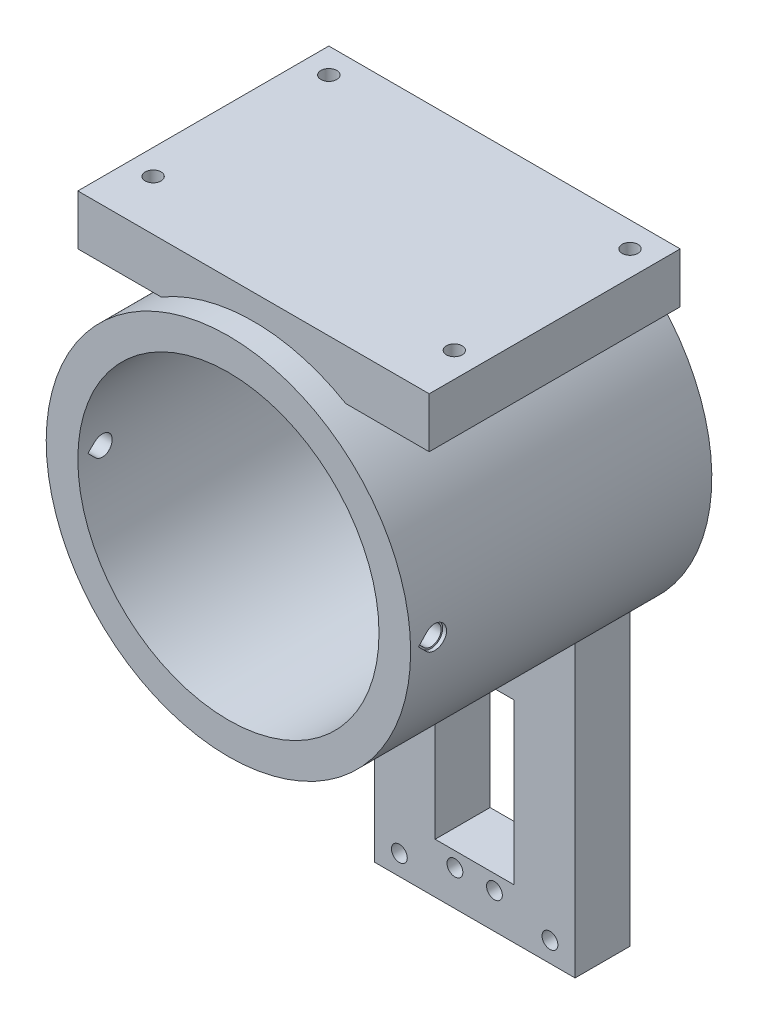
ISO-10303-21;
HEADER;
FILE_DESCRIPTION(('STEP AP214'),'2;1');
FILE_NAME('part.step','',(''),(''),'','','');
FILE_SCHEMA(('AUTOMOTIVE_DESIGN { 1 0 10303 214 1 1 1 1 }'));
ENDSEC;
DATA;
#1=APPLICATION_CONTEXT('core data for automotive mechanical design processes');
#2=APPLICATION_PROTOCOL_DEFINITION('international standard','automotive_design',2000,#1);
#3=PRODUCT_CONTEXT('',#1,'mechanical');
#4=PRODUCT('Part','Part','',(#3));
#5=PRODUCT_RELATED_PRODUCT_CATEGORY('part','',(#4));
#6=PRODUCT_DEFINITION_FORMATION('','',#4);
#7=PRODUCT_DEFINITION_CONTEXT('part definition',#1,'design');
#8=PRODUCT_DEFINITION('design','',#6,#7);
#9=PRODUCT_DEFINITION_SHAPE('','',#8);
#10=(LENGTH_UNIT() NAMED_UNIT(*) SI_UNIT(.MILLI.,.METRE.));
#11=(NAMED_UNIT(*) PLANE_ANGLE_UNIT() SI_UNIT($,.RADIAN.));
#12=(NAMED_UNIT(*) SI_UNIT($,.STERADIAN.) SOLID_ANGLE_UNIT());
#13=UNCERTAINTY_MEASURE_WITH_UNIT(LENGTH_MEASURE(1.E-05),#10,'distance_accuracy_value','');
#14=(GEOMETRIC_REPRESENTATION_CONTEXT(3) GLOBAL_UNCERTAINTY_ASSIGNED_CONTEXT((#13)) GLOBAL_UNIT_ASSIGNED_CONTEXT((#10,
#11,#12)) REPRESENTATION_CONTEXT('',''));
#15=CARTESIAN_POINT('',(0.,0.,0.));
#16=DIRECTION('',(0.,0.,1.));
#17=DIRECTION('',(1.,0.,0.));
#18=AXIS2_PLACEMENT_3D('',#15,#16,#17);
#19=CARTESIAN_POINT('',(0.,0.,76.2));
#20=DIRECTION('',(0.,0.,-1.));
#21=DIRECTION('',(-1.,0.,0.));
#22=AXIS2_PLACEMENT_3D('',#19,#20,#21);
#23=CYLINDRICAL_SURFACE('',#22,46.1);
#24=CARTESIAN_POINT('',(-46.0527822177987,2.08596500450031,72.1397204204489));
#25=CARTESIAN_POINT('',(-46.0501254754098,2.14461818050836,72.0810782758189));
#26=CARTESIAN_POINT('',(-46.0474691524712,2.2007844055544,72.0199543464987));
#27=CARTESIAN_POINT('',(-46.0422311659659,2.30777359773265,71.893197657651));
#28=CARTESIAN_POINT('',(-46.0396494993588,2.35859678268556,71.8275650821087));
#29=CARTESIAN_POINT('',(-46.0346359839,2.45450541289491,71.6922832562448));
#30=CARTESIAN_POINT('',(-46.0322040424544,2.49959442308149,71.6226365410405));
#31=CARTESIAN_POINT('',(-46.0275572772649,2.58374559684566,71.4798123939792));
#32=CARTESIAN_POINT('',(-46.0253424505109,2.62280784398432,71.4066350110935));
#33=CARTESIAN_POINT('',(-46.0191190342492,2.73055138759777,71.1824790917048));
#34=CARTESIAN_POINT('',(-46.0155295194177,2.78982609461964,71.026825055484));
#35=CARTESIAN_POINT('',(-46.0098893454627,2.88135391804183,70.7078665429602));
#36=CARTESIAN_POINT('',(-46.0078383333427,2.9136132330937,70.5445638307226));
#37=CARTESIAN_POINT('',(-46.0055043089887,2.95024008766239,70.215039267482));
#38=CARTESIAN_POINT('',(-46.0052190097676,2.95464370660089,70.0488214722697));
#39=CARTESIAN_POINT('',(-46.0064437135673,2.93551103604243,69.7179884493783));
#40=CARTESIAN_POINT('',(-46.0079539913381,2.91197047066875,69.5533734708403));
#41=CARTESIAN_POINT('',(-46.0125968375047,2.83765779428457,69.2305910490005));
#42=CARTESIAN_POINT('',(-46.0157279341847,2.78691038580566,69.072417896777));
#43=CARTESIAN_POINT('',(-46.0232581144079,2.65965249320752,68.7668440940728));
#44=CARTESIAN_POINT('',(-46.027657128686,2.58314341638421,68.6194428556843));
#45=CARTESIAN_POINT('',(-46.0372350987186,2.40640757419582,68.3393569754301));
#46=CARTESIAN_POINT('',(-46.0424151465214,2.30614748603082,68.2066933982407));
#47=CARTESIAN_POINT('',(-46.0529678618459,2.08480099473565,67.960059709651));
#48=CARTESIAN_POINT('',(-46.058340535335,1.96371394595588,67.8460901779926));
#49=CARTESIAN_POINT('',(-46.068682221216,1.70393897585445,67.639914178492));
#50=CARTESIAN_POINT('',(-46.0736506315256,1.56522556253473,67.5477397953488));
#51=CARTESIAN_POINT('',(-46.0826150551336,1.2742628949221,67.3879913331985));
#52=CARTESIAN_POINT('',(-46.0866110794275,1.12201379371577,67.3204169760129));
#53=CARTESIAN_POINT('',(-46.0931776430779,0.808413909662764,67.2118405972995));
#54=CARTESIAN_POINT('',(-46.0957492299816,0.647069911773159,67.1708190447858));
#55=CARTESIAN_POINT('',(-46.0991813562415,0.319767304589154,67.1164490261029));
#56=CARTESIAN_POINT('',(-46.1000419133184,0.15380874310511,67.1031002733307));
#57=CARTESIAN_POINT('',(-46.0999549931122,-0.177694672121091,67.1044589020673));
#58=CARTESIAN_POINT('',(-46.0990107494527,-0.343239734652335,67.1191161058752));
#59=CARTESIAN_POINT('',(-46.0954268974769,-0.669512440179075,67.1759655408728));
#60=CARTESIAN_POINT('',(-46.0927872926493,-0.830240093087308,67.2181577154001));
#61=CARTESIAN_POINT('',(-46.0861095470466,-1.14231596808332,67.3288654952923));
#62=CARTESIAN_POINT('',(-46.0820714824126,-1.29366470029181,67.3973796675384));
#63=CARTESIAN_POINT('',(-46.073049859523,-1.58272374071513,67.5587828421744));
#64=CARTESIAN_POINT('',(-46.0680662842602,-1.72043380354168,67.6516722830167));
#65=CARTESIAN_POINT('',(-46.05770314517,-1.97856703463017,67.8593841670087));
#66=CARTESIAN_POINT('',(-46.052322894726,-2.09895911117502,67.9742452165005));
#67=CARTESIAN_POINT('',(-46.0417796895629,-2.31876306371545,68.2225456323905));
#68=CARTESIAN_POINT('',(-46.0366167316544,-2.4181752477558,68.3559847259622));
#69=CARTESIAN_POINT('',(-46.0270858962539,-2.59327748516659,68.6377917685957));
#70=CARTESIAN_POINT('',(-46.0227186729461,-2.66894805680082,68.7861718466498));
#71=CARTESIAN_POINT('',(-46.015278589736,-2.79429822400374,69.0935732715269));
#72=CARTESIAN_POINT('',(-46.0122057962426,-2.84397648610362,69.2525951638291));
#73=CARTESIAN_POINT('',(-46.0077066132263,-2.91586032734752,69.5765260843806));
#74=CARTESIAN_POINT('',(-46.0062779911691,-2.93810316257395,69.7414268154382));
#75=CARTESIAN_POINT('',(-46.0052219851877,-2.95459334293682,70.0726084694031));
#76=CARTESIAN_POINT('',(-46.0055943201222,-2.94884505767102,70.2388891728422));
#77=CARTESIAN_POINT('',(-46.0080944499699,-2.90957443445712,70.5678505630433));
#78=CARTESIAN_POINT('',(-46.0102196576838,-2.87609302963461,70.730536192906));
#79=CARTESIAN_POINT('',(-46.0159863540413,-2.78229959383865,71.0480799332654));
#80=CARTESIAN_POINT('',(-46.019628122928,-2.72198260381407,71.2029365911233));
#81=CARTESIAN_POINT('',(-46.0258692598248,-2.61354383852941,71.4243376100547));
#82=CARTESIAN_POINT('',(-46.0280540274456,-2.57487250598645,71.4956690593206));
#83=CARTESIAN_POINT('',(-46.0326270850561,-2.49178251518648,71.6349208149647));
#84=CARTESIAN_POINT('',(-46.0350153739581,-2.4473638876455,71.7028411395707));
#85=CARTESIAN_POINT('',(-46.0399316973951,-2.35306544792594,71.8348122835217));
#86=CARTESIAN_POINT('',(-46.0424597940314,-2.30318319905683,71.8988613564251));
#87=CARTESIAN_POINT('',(-46.0475858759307,-2.19831527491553,72.0226383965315));
#88=CARTESIAN_POINT('',(-46.0501838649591,-2.1433293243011,72.0823661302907));
#89=CARTESIAN_POINT('',(-46.0527822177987,-2.08596500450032,72.1397204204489));
#90=B_SPLINE_CURVE_WITH_KNOTS('',3,(#24,#25,#26,#27,#28,#29,#30,#31,#32,#33,#34,#35,#36,#37,#38,
#39,#40,#41,#42,#43,#44,#45,#46,#47,#48,#49,#50,#51,#52,#53,#54,#55,#56,#57,#58,#59,#60,#61,#62,
#63,#64,#65,#66,#67,#68,#69,#70,#71,#72,#73,#74,#75,#76,#77,#78,#79,#80,#81,#82,#83,#84,#85,#86,
#87,#88,#89),.UNSPECIFIED.,.F.,.F.,(4,2,2,2,2,2,2,2,2,2,2,2,2,2,2,2,2,2,2,2,2,2,2,2,2,2,2,2,2,2,
2,2,4),(0.,0.248867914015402,0.497725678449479,0.74642796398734,0.995126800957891,
1.49233666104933,1.98943240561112,2.48588416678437,2.98241190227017,3.47848957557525,
3.97454015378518,4.47129085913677,4.96805696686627,5.46554987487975,5.96303715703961,
6.46015809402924,6.95727388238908,7.45349983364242,7.94972476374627,8.4459226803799,
8.94212952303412,9.43921639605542,9.93629596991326,10.4337823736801,10.93129429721,
11.4281298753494,11.9248878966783,12.4209140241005,12.9170318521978,13.1603152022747,
13.4035972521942,13.6469882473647,13.8903923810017),.UNSPECIFIED.);
#91=CARTESIAN_POINT('',(-46.0527822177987,2.08596500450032,72.1397204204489));
#92=VERTEX_POINT('',#91);
#93=CARTESIAN_POINT('',(-46.0527822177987,-2.08596500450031,72.1397204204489));
#94=VERTEX_POINT('',#93);
#95=EDGE_CURVE('E457',#92,#94,#90,.T.);
#96=ORIENTED_EDGE('',*,*,#95,.F.);
#97=CARTESIAN_POINT('',(0.,0.,74.2256854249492));
#98=DIRECTION('',(0.,-0.707106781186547,-0.707106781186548));
#99=DIRECTION('',(0.,0.707106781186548,-0.707106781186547));
#100=AXIS2_PLACEMENT_3D('',#97,#98,#99);
#101=ELLIPSE('',#100,65.1952452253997,46.1);
#102=CARTESIAN_POINT('',(-46.1,0.,74.2256854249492));
#103=VERTEX_POINT('',#102);
#104=EDGE_CURVE('E454',#103,#92,#101,.T.);
#105=ORIENTED_EDGE('',*,*,#104,.F.);
#106=CARTESIAN_POINT('',(0.,0.,74.2256854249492));
#107=DIRECTION('',(0.,0.707106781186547,-0.707106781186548));
#108=DIRECTION('',(0.,-0.707106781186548,-0.707106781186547));
#109=AXIS2_PLACEMENT_3D('',#106,#107,#108);
#110=ELLIPSE('',#109,65.1952452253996,46.1);
#111=EDGE_CURVE('E452',#94,#103,#110,.T.);
#112=ORIENTED_EDGE('',*,*,#111,.F.);
#113=EDGE_LOOP('',(#96,#105,#112));
#114=FACE_BOUND('',#113,.T.);
#115=CARTESIAN_POINT('',(0.,0.,74.2256854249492));
#116=DIRECTION('',(0.,0.707106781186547,0.707106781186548));
#117=DIRECTION('',(0.,0.707106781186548,-0.707106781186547));
#118=AXIS2_PLACEMENT_3D('',#115,#116,#117);
#119=ELLIPSE('',#118,65.1952452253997,46.1);
#120=CARTESIAN_POINT('',(46.1,0.,74.2256854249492));
#121=VERTEX_POINT('',#120);
#122=CARTESIAN_POINT('',(46.0527822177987,2.08596500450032,72.1397204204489));
#123=VERTEX_POINT('',#122);
#124=EDGE_CURVE('E449',#121,#123,#119,.T.);
#125=ORIENTED_EDGE('',*,*,#124,.T.);
#126=CARTESIAN_POINT('',(46.0527822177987,2.08596500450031,72.1397204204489));
#127=CARTESIAN_POINT('',(46.0501254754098,2.14461818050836,72.0810782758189));
#128=CARTESIAN_POINT('',(46.0474691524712,2.2007844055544,72.0199543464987));
#129=CARTESIAN_POINT('',(46.0422311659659,2.30777359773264,71.893197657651));
#130=CARTESIAN_POINT('',(46.0396494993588,2.35859678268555,71.8275650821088));
#131=CARTESIAN_POINT('',(46.0346359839,2.4545054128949,71.6922832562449));
#132=CARTESIAN_POINT('',(46.0322040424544,2.49959442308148,71.6226365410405));
#133=CARTESIAN_POINT('',(46.0275572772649,2.58374559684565,71.4798123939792));
#134=CARTESIAN_POINT('',(46.0253424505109,2.62280784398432,71.4066350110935));
#135=CARTESIAN_POINT('',(46.0191190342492,2.73055138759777,71.1824790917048));
#136=CARTESIAN_POINT('',(46.0155295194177,2.78982609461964,71.026825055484));
#137=CARTESIAN_POINT('',(46.0098893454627,2.88135391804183,70.7078665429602));
#138=CARTESIAN_POINT('',(46.0078383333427,2.9136132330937,70.5445638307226));
#139=CARTESIAN_POINT('',(46.0055043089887,2.9502400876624,70.215039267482));
#140=CARTESIAN_POINT('',(46.0052190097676,2.95464370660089,70.0488214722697));
#141=CARTESIAN_POINT('',(46.0064437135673,2.93551103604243,69.7179884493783));
#142=CARTESIAN_POINT('',(46.0079539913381,2.91197047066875,69.5533734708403));
#143=CARTESIAN_POINT('',(46.0125968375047,2.83765779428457,69.2305910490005));
#144=CARTESIAN_POINT('',(46.0157279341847,2.78691038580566,69.072417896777));
#145=CARTESIAN_POINT('',(46.0232581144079,2.65965249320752,68.7668440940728));
#146=CARTESIAN_POINT('',(46.027657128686,2.58314341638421,68.6194428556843));
#147=CARTESIAN_POINT('',(46.0372350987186,2.40640757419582,68.3393569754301));
#148=CARTESIAN_POINT('',(46.0424151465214,2.30614748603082,68.2066933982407));
#149=CARTESIAN_POINT('',(46.0529678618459,2.08480099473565,67.960059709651));
#150=CARTESIAN_POINT('',(46.058340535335,1.96371394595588,67.8460901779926));
#151=CARTESIAN_POINT('',(46.068682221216,1.70393897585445,67.639914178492));
#152=CARTESIAN_POINT('',(46.0736506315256,1.56522556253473,67.5477397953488));
#153=CARTESIAN_POINT('',(46.0826150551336,1.2742628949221,67.3879913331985));
#154=CARTESIAN_POINT('',(46.0866110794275,1.12201379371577,67.3204169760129));
#155=CARTESIAN_POINT('',(46.0931776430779,0.808413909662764,67.2118405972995));
#156=CARTESIAN_POINT('',(46.0957492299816,0.64706991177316,67.1708190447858));
#157=CARTESIAN_POINT('',(46.0991813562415,0.319767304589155,67.1164490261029));
#158=CARTESIAN_POINT('',(46.1000419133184,0.153808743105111,67.1031002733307));
#159=CARTESIAN_POINT('',(46.0999549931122,-0.17769467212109,67.1044589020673));
#160=CARTESIAN_POINT('',(46.0990107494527,-0.343239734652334,67.1191161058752));
#161=CARTESIAN_POINT('',(46.0954268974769,-0.669512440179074,67.1759655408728));
#162=CARTESIAN_POINT('',(46.0927872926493,-0.830240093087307,67.2181577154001));
#163=CARTESIAN_POINT('',(46.0861095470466,-1.14231596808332,67.3288654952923));
#164=CARTESIAN_POINT('',(46.0820714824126,-1.29366470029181,67.3973796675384));
#165=CARTESIAN_POINT('',(46.073049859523,-1.58272374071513,67.5587828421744));
#166=CARTESIAN_POINT('',(46.0680662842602,-1.72043380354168,67.6516722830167));
#167=CARTESIAN_POINT('',(46.05770314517,-1.97856703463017,67.8593841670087));
#168=CARTESIAN_POINT('',(46.052322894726,-2.09895911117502,67.9742452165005));
#169=CARTESIAN_POINT('',(46.0417796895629,-2.31876306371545,68.2225456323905));
#170=CARTESIAN_POINT('',(46.0366167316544,-2.4181752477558,68.3559847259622));
#171=CARTESIAN_POINT('',(46.0270858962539,-2.59327748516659,68.6377917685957));
#172=CARTESIAN_POINT('',(46.0227186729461,-2.66894805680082,68.7861718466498));
#173=CARTESIAN_POINT('',(46.015278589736,-2.79429822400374,69.0935732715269));
#174=CARTESIAN_POINT('',(46.0122057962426,-2.84397648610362,69.2525951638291));
#175=CARTESIAN_POINT('',(46.0077066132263,-2.91586032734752,69.5765260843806));
#176=CARTESIAN_POINT('',(46.0062779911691,-2.93810316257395,69.7414268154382));
#177=CARTESIAN_POINT('',(46.0052219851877,-2.95459334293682,70.0726084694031));
#178=CARTESIAN_POINT('',(46.0055943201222,-2.94884505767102,70.2388891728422));
#179=CARTESIAN_POINT('',(46.0080944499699,-2.90957443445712,70.5678505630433));
#180=CARTESIAN_POINT('',(46.0102196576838,-2.87609302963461,70.730536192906));
#181=CARTESIAN_POINT('',(46.0159863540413,-2.78229959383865,71.0480799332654));
#182=CARTESIAN_POINT('',(46.019628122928,-2.72198260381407,71.2029365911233));
#183=CARTESIAN_POINT('',(46.0258692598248,-2.61354383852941,71.4243376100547));
#184=CARTESIAN_POINT('',(46.0280540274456,-2.57487250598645,71.4956690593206));
#185=CARTESIAN_POINT('',(46.0326270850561,-2.49178251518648,71.6349208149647));
#186=CARTESIAN_POINT('',(46.0350153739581,-2.4473638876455,71.7028411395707));
#187=CARTESIAN_POINT('',(46.0399316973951,-2.35306544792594,71.8348122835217));
#188=CARTESIAN_POINT('',(46.0424597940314,-2.30318319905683,71.8988613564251));
#189=CARTESIAN_POINT('',(46.0475858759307,-2.19831527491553,72.0226383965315));
#190=CARTESIAN_POINT('',(46.0501838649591,-2.1433293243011,72.0823661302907));
#191=CARTESIAN_POINT('',(46.0527822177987,-2.08596500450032,72.1397204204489));
#192=B_SPLINE_CURVE_WITH_KNOTS('',3,(#126,#127,#128,#129,#130,#131,#132,#133,#134,#135,#136,
#137,#138,#139,#140,#141,#142,#143,#144,#145,#146,#147,#148,#149,#150,#151,#152,#153,#154,#155,
#156,#157,#158,#159,#160,#161,#162,#163,#164,#165,#166,#167,#168,#169,#170,#171,#172,#173,#174,
#175,#176,#177,#178,#179,#180,#181,#182,#183,#184,#185,#186,#187,#188,#189,#190,#191),
.UNSPECIFIED.,.F.,.F.,(4,2,2,2,2,2,2,2,2,2,2,2,2,2,2,2,2,2,2,2,2,2,2,2,2,2,2,2,2,2,2,2,4),(0.,
0.248867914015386,0.497725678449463,0.746427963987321,0.995126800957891,1.49233666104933,
1.98943240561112,2.48588416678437,2.98241190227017,3.47848957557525,3.97454015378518,
4.47129085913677,4.96805696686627,5.46554987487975,5.96303715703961,6.46015809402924,
6.95727388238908,7.45349983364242,7.94972476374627,8.4459226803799,8.94212952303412,
9.43921639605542,9.93629596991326,10.4337823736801,10.93129429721,11.4281298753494,
11.9248878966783,12.4209140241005,12.9170318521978,13.1603152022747,13.4035972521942,
13.6469882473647,13.8903923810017),.UNSPECIFIED.);
#193=CARTESIAN_POINT('',(46.0527822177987,-2.08596500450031,72.1397204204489));
#194=VERTEX_POINT('',#193);
#195=EDGE_CURVE('E438',#123,#194,#192,.T.);
#196=ORIENTED_EDGE('',*,*,#195,.T.);
#197=CARTESIAN_POINT('',(0.,0.,74.2256854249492));
#198=DIRECTION('',(0.,-0.707106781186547,0.707106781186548));
#199=DIRECTION('',(0.,-0.707106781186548,-0.707106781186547));
#200=AXIS2_PLACEMENT_3D('',#197,#198,#199);
#201=ELLIPSE('',#200,65.1952452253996,46.1);
#202=EDGE_CURVE('E445',#194,#121,#201,.T.);
#203=ORIENTED_EDGE('',*,*,#202,.T.);
#204=EDGE_LOOP('',(#125,#196,#203));
#205=FACE_BOUND('',#204,.T.);
#206=CARTESIAN_POINT('',(0.,0.,76.2));
#207=DIRECTION('',(0.,0.,1.));
#208=DIRECTION('',(1.,0.,0.));
#209=AXIS2_PLACEMENT_3D('',#206,#207,#208);
#210=CIRCLE('',#209,46.1);
#211=CARTESIAN_POINT('',(46.1,0.,76.2));
#212=VERTEX_POINT('',#211);
#213=EDGE_CURVE('E393',#212,#212,#210,.T.);
#214=ORIENTED_EDGE('',*,*,#213,.F.);
#215=EDGE_LOOP('',(#214));
#216=FACE_BOUND('',#215,.T.);
#217=DIRECTION('',(0.,0.,-1.));
#218=VECTOR('',#217,1.);
#219=CARTESIAN_POINT('',(-25.4,-38.4714179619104,76.2));
#220=LINE('',#219,#218);
#221=CARTESIAN_POINT('',(-25.4,-38.4714179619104,13.899999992));
#222=VERTEX_POINT('',#221);
#223=CARTESIAN_POINT('',(-25.4,-38.4714179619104,0.));
#224=VERTEX_POINT('',#223);
#225=EDGE_CURVE('E400',#222,#224,#220,.T.);
#226=ORIENTED_EDGE('',*,*,#225,.F.);
#227=CARTESIAN_POINT('',(0.,0.,13.899999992));
#228=DIRECTION('',(0.,0.,1.));
#229=DIRECTION('',(1.,0.,0.));
#230=AXIS2_PLACEMENT_3D('',#227,#228,#229);
#231=CIRCLE('',#230,46.1);
#232=CARTESIAN_POINT('',(25.4,-38.4714179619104,13.899999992));
#233=VERTEX_POINT('',#232);
#234=EDGE_CURVE('E282',#222,#233,#231,.T.);
#235=ORIENTED_EDGE('',*,*,#234,.T.);
#236=DIRECTION('',(0.,0.,-1.));
#237=VECTOR('',#236,1.);
#238=CARTESIAN_POINT('',(25.4,-38.4714179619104,76.2));
#239=LINE('',#238,#237);
#240=CARTESIAN_POINT('',(25.4,-38.4714179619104,0.));
#241=VERTEX_POINT('',#240);
#242=EDGE_CURVE('E394',#233,#241,#239,.T.);
#243=ORIENTED_EDGE('',*,*,#242,.T.);
#244=CARTESIAN_POINT('',(0.,0.,0.));
#245=DIRECTION('',(0.,0.,1.));
#246=DIRECTION('',(1.,0.,0.));
#247=AXIS2_PLACEMENT_3D('',#244,#245,#246);
#248=CIRCLE('',#247,46.1);
#249=EDGE_CURVE('E381',#241,#224,#248,.T.);
#250=ORIENTED_EDGE('',*,*,#249,.T.);
#251=EDGE_LOOP('',(#226,#235,#243,#250));
#252=FACE_BOUND('',#251,.T.);
#253=DIRECTION('',(0.,0.,-1.));
#254=VECTOR('',#253,1.);
#255=CARTESIAN_POINT('',(23.3483939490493,39.75,76.2));
#256=LINE('',#255,#254);
#257=CARTESIAN_POINT('',(23.3483939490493,39.75,69.85));
#258=VERTEX_POINT('',#257);
#259=CARTESIAN_POINT('',(23.3483939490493,39.75,6.34999999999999));
#260=VERTEX_POINT('',#259);
#261=EDGE_CURVE('E12',#258,#260,#256,.T.);
#262=ORIENTED_EDGE('',*,*,#261,.F.);
#263=CARTESIAN_POINT('',(0.,0.,69.85));
#264=DIRECTION('',(0.,0.,1.));
#265=DIRECTION('',(1.,0.,0.));
#266=AXIS2_PLACEMENT_3D('',#263,#264,#265);
#267=CIRCLE('',#266,46.1);
#268=CARTESIAN_POINT('',(-23.3483939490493,39.75,69.85));
#269=VERTEX_POINT('',#268);
#270=EDGE_CURVE('E930',#258,#269,#267,.T.);
#271=ORIENTED_EDGE('',*,*,#270,.T.);
#272=DIRECTION('',(0.,0.,-1.));
#273=VECTOR('',#272,1.);
#274=CARTESIAN_POINT('',(-23.3483939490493,39.75,76.2));
#275=LINE('',#274,#273);
#276=CARTESIAN_POINT('',(-23.3483939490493,39.75,6.35000000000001));
#277=VERTEX_POINT('',#276);
#278=EDGE_CURVE('E927',#277,#269,#275,.F.);
#279=ORIENTED_EDGE('',*,*,#278,.F.);
#280=CARTESIAN_POINT('',(0.,0.,6.34999999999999));
#281=DIRECTION('',(0.,0.,-1.));
#282=DIRECTION('',(-1.,0.,0.));
#283=AXIS2_PLACEMENT_3D('',#280,#281,#282);
#284=CIRCLE('',#283,46.1);
#285=EDGE_CURVE('E49',#277,#260,#284,.T.);
#286=ORIENTED_EDGE('',*,*,#285,.T.);
#287=EDGE_LOOP('',(#262,#271,#279,#286));
#288=FACE_BOUND('',#287,.T.);
#289=ADVANCED_FACE('F41',(#114,#205,#216,#252,#288),#23,.T.);
#290=CARTESIAN_POINT('',(-25.4,-38.4714179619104,76.2));
#291=DIRECTION('',(1.,0.,0.));
#292=DIRECTION('',(0.,1.,0.));
#293=AXIS2_PLACEMENT_3D('',#290,#291,#292);
#294=PLANE('',#293);
#295=DIRECTION('',(0.,1.,0.));
#296=VECTOR('',#295,1.);
#297=CARTESIAN_POINT('',(-25.4,-38.4714179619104,13.899999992));
#298=LINE('',#297,#296);
#299=CARTESIAN_POINT('',(-25.4,-113.05,13.899999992));
#300=VERTEX_POINT('',#299);
#301=EDGE_CURVE('E284',#300,#222,#298,.T.);
#302=ORIENTED_EDGE('',*,*,#301,.T.);
#303=ORIENTED_EDGE('',*,*,#225,.T.);
#304=DIRECTION('',(0.,-1.,0.));
#305=VECTOR('',#304,1.);
#306=CARTESIAN_POINT('',(-25.4,-38.4714179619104,0.));
#307=LINE('',#306,#305);
#308=CARTESIAN_POINT('',(-25.4,-113.05,0.));
#309=VERTEX_POINT('',#308);
#310=EDGE_CURVE('E384',#224,#309,#307,.T.);
#311=ORIENTED_EDGE('',*,*,#310,.T.);
#312=DIRECTION('',(0.,0.,-1.));
#313=VECTOR('',#312,1.);
#314=CARTESIAN_POINT('',(-25.4,-113.05,76.2));
#315=LINE('',#314,#313);
#316=EDGE_CURVE('E398',#300,#309,#315,.T.);
#317=ORIENTED_EDGE('',*,*,#316,.F.);
#318=EDGE_LOOP('',(#302,#303,#311,#317));
#319=FACE_BOUND('',#318,.T.);
#320=ADVANCED_FACE('F489',(#319),#294,.F.);
#321=CARTESIAN_POINT('',(-25.4,-113.05,76.2));
#322=DIRECTION('',(0.,1.,0.));
#323=DIRECTION('',(0.,0.,1.));
#324=AXIS2_PLACEMENT_3D('',#321,#322,#323);
#325=PLANE('',#324);
#326=DIRECTION('',(-1.,0.,0.));
#327=VECTOR('',#326,1.);
#328=CARTESIAN_POINT('',(-25.4,-113.05,13.899999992));
#329=LINE('',#328,#327);
#330=CARTESIAN_POINT('',(25.4,-113.05,13.899999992));
#331=VERTEX_POINT('',#330);
#332=EDGE_CURVE('E275',#331,#300,#329,.T.);
#333=ORIENTED_EDGE('',*,*,#332,.T.);
#334=ORIENTED_EDGE('',*,*,#316,.T.);
#335=DIRECTION('',(1.,0.,0.));
#336=VECTOR('',#335,1.);
#337=CARTESIAN_POINT('',(-25.4,-113.05,0.));
#338=LINE('',#337,#336);
#339=CARTESIAN_POINT('',(25.4,-113.05,0.));
#340=VERTEX_POINT('',#339);
#341=EDGE_CURVE('E387',#309,#340,#338,.T.);
#342=ORIENTED_EDGE('',*,*,#341,.T.);
#343=DIRECTION('',(0.,0.,-1.));
#344=VECTOR('',#343,1.);
#345=CARTESIAN_POINT('',(25.4,-113.05,76.2));
#346=LINE('',#345,#344);
#347=EDGE_CURVE('E396',#331,#340,#346,.T.);
#348=ORIENTED_EDGE('',*,*,#347,.F.);
#349=EDGE_LOOP('',(#333,#334,#342,#348));
#350=FACE_BOUND('',#349,.T.);
#351=ADVANCED_FACE('F496',(#350),#325,.F.);
#352=CARTESIAN_POINT('',(25.4,-38.4714179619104,76.2));
#353=DIRECTION('',(-1.,0.,0.));
#354=DIRECTION('',(0.,-1.,0.));
#355=AXIS2_PLACEMENT_3D('',#352,#353,#354);
#356=PLANE('',#355);
#357=DIRECTION('',(0.,-1.,0.));
#358=VECTOR('',#357,1.);
#359=CARTESIAN_POINT('',(25.4,-38.4714179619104,13.899999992));
#360=LINE('',#359,#358);
#361=EDGE_CURVE('E278',#233,#331,#360,.T.);
#362=ORIENTED_EDGE('',*,*,#361,.T.);
#363=ORIENTED_EDGE('',*,*,#347,.T.);
#364=DIRECTION('',(0.,1.,0.));
#365=VECTOR('',#364,1.);
#366=CARTESIAN_POINT('',(25.4,-38.4714179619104,0.));
#367=LINE('',#366,#365);
#368=EDGE_CURVE('E390',#340,#241,#367,.T.);
#369=ORIENTED_EDGE('',*,*,#368,.T.);
#370=ORIENTED_EDGE('',*,*,#242,.F.);
#371=EDGE_LOOP('',(#362,#363,#369,#370));
#372=FACE_BOUND('',#371,.T.);
#373=ADVANCED_FACE('F521',(#372),#356,.F.);
#374=CARTESIAN_POINT('',(-10.,-59.85,76.2));
#375=DIRECTION('',(1.,0.,0.));
#376=DIRECTION('',(0.,1.,0.));
#377=AXIS2_PLACEMENT_3D('',#374,#375,#376);
#378=PLANE('',#377);
#379=DIRECTION('',(0.,0.,-1.));
#380=VECTOR('',#379,1.);
#381=CARTESIAN_POINT('',(-10.,-59.85,76.2));
#382=LINE('',#381,#380);
#383=CARTESIAN_POINT('',(-10.,-59.85,13.899999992));
#384=VERTEX_POINT('',#383);
#385=CARTESIAN_POINT('',(-10.,-59.85,0.));
#386=VERTEX_POINT('',#385);
#387=EDGE_CURVE('E373',#384,#386,#382,.T.);
#388=ORIENTED_EDGE('',*,*,#387,.F.);
#389=DIRECTION('',(0.,-1.,0.));
#390=VECTOR('',#389,1.);
#391=CARTESIAN_POINT('',(-10.,-59.85,13.899999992));
#392=LINE('',#391,#390);
#393=CARTESIAN_POINT('',(-10.,-100.35,13.899999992));
#394=VERTEX_POINT('',#393);
#395=EDGE_CURVE('E293',#384,#394,#392,.T.);
#396=ORIENTED_EDGE('',*,*,#395,.T.);
#397=DIRECTION('',(0.,0.,-1.));
#398=VECTOR('',#397,1.);
#399=CARTESIAN_POINT('',(-10.,-100.35,76.2));
#400=LINE('',#399,#398);
#401=CARTESIAN_POINT('',(-10.,-100.35,0.));
#402=VERTEX_POINT('',#401);
#403=EDGE_CURVE('E379',#394,#402,#400,.T.);
#404=ORIENTED_EDGE('',*,*,#403,.T.);
#405=DIRECTION('',(0.,-1.,0.));
#406=VECTOR('',#405,1.);
#407=CARTESIAN_POINT('',(-10.,-59.85,0.));
#408=LINE('',#407,#406);
#409=EDGE_CURVE('E359',#386,#402,#408,.T.);
#410=ORIENTED_EDGE('',*,*,#409,.F.);
#411=EDGE_LOOP('',(#388,#396,#404,#410));
#412=FACE_BOUND('',#411,.T.);
#413=ADVANCED_FACE('F523',(#412),#378,.T.);
#414=CARTESIAN_POINT('',(-10.,-100.35,76.2));
#415=DIRECTION('',(0.,1.,0.));
#416=DIRECTION('',(0.,0.,1.));
#417=AXIS2_PLACEMENT_3D('',#414,#415,#416);
#418=PLANE('',#417);
#419=ORIENTED_EDGE('',*,*,#403,.F.);
#420=DIRECTION('',(1.,0.,0.));
#421=VECTOR('',#420,1.);
#422=CARTESIAN_POINT('',(-10.,-100.35,13.899999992));
#423=LINE('',#422,#421);
#424=CARTESIAN_POINT('',(10.,-100.35,13.899999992));
#425=VERTEX_POINT('',#424);
#426=EDGE_CURVE('E290',#394,#425,#423,.T.);
#427=ORIENTED_EDGE('',*,*,#426,.T.);
#428=DIRECTION('',(0.,0.,-1.));
#429=VECTOR('',#428,1.);
#430=CARTESIAN_POINT('',(10.,-100.35,76.2));
#431=LINE('',#430,#429);
#432=CARTESIAN_POINT('',(10.,-100.35,0.));
#433=VERTEX_POINT('',#432);
#434=EDGE_CURVE('E377',#425,#433,#431,.T.);
#435=ORIENTED_EDGE('',*,*,#434,.T.);
#436=DIRECTION('',(1.,0.,0.));
#437=VECTOR('',#436,1.);
#438=CARTESIAN_POINT('',(-10.,-100.35,0.));
#439=LINE('',#438,#437);
#440=EDGE_CURVE('E364',#402,#433,#439,.T.);
#441=ORIENTED_EDGE('',*,*,#440,.F.);
#442=EDGE_LOOP('',(#419,#427,#435,#441));
#443=FACE_BOUND('',#442,.T.);
#444=ADVANCED_FACE('F529',(#443),#418,.T.);
#445=CARTESIAN_POINT('',(10.,-59.85,76.2));
#446=DIRECTION('',(-1.,0.,0.));
#447=DIRECTION('',(0.,0.,1.));
#448=AXIS2_PLACEMENT_3D('',#445,#446,#447);
#449=PLANE('',#448);
#450=ORIENTED_EDGE('',*,*,#434,.F.);
#451=DIRECTION('',(0.,1.,0.));
#452=VECTOR('',#451,1.);
#453=CARTESIAN_POINT('',(10.,-59.85,13.899999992));
#454=LINE('',#453,#452);
#455=CARTESIAN_POINT('',(10.,-59.85,13.899999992));
#456=VERTEX_POINT('',#455);
#457=EDGE_CURVE('E287',#425,#456,#454,.T.);
#458=ORIENTED_EDGE('',*,*,#457,.T.);
#459=DIRECTION('',(0.,0.,-1.));
#460=VECTOR('',#459,1.);
#461=CARTESIAN_POINT('',(10.,-59.85,76.2));
#462=LINE('',#461,#460);
#463=CARTESIAN_POINT('',(10.,-59.85,0.));
#464=VERTEX_POINT('',#463);
#465=EDGE_CURVE('E375',#456,#464,#462,.T.);
#466=ORIENTED_EDGE('',*,*,#465,.T.);
#467=DIRECTION('',(0.,1.,0.));
#468=VECTOR('',#467,1.);
#469=CARTESIAN_POINT('',(10.,-59.85,0.));
#470=LINE('',#469,#468);
#471=EDGE_CURVE('E367',#433,#464,#470,.T.);
#472=ORIENTED_EDGE('',*,*,#471,.F.);
#473=EDGE_LOOP('',(#450,#458,#466,#472));
#474=FACE_BOUND('',#473,.T.);
#475=ADVANCED_FACE('F543',(#474),#449,.T.);
#476=CARTESIAN_POINT('',(-10.,-59.85,76.2));
#477=DIRECTION('',(0.,-1.,0.));
#478=DIRECTION('',(1.,0.,0.));
#479=AXIS2_PLACEMENT_3D('',#476,#477,#478);
#480=PLANE('',#479);
#481=ORIENTED_EDGE('',*,*,#465,.F.);
#482=DIRECTION('',(-1.,0.,0.));
#483=VECTOR('',#482,1.);
#484=CARTESIAN_POINT('',(-10.,-59.85,13.899999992));
#485=LINE('',#484,#483);
#486=EDGE_CURVE('E465',#456,#384,#485,.T.);
#487=ORIENTED_EDGE('',*,*,#486,.T.);
#488=ORIENTED_EDGE('',*,*,#387,.T.);
#489=DIRECTION('',(-1.,0.,0.));
#490=VECTOR('',#489,1.);
#491=CARTESIAN_POINT('',(-10.,-59.85,0.));
#492=LINE('',#491,#490);
#493=EDGE_CURVE('E370',#464,#386,#492,.T.);
#494=ORIENTED_EDGE('',*,*,#493,.F.);
#495=EDGE_LOOP('',(#481,#487,#488,#494));
#496=FACE_BOUND('',#495,.T.);
#497=ADVANCED_FACE('F546',(#496),#480,.T.);
#498=CARTESIAN_POINT('',(-46.1,0.,70.0537554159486));
#499=DIRECTION('',(1.,0.,0.));
#500=DIRECTION('',(0.,0.,-1.));
#501=AXIS2_PLACEMENT_3D('',#498,#499,#500);
#502=CYLINDRICAL_SURFACE('',#501,2.55);
#503=CARTESIAN_POINT('',(-45.1,0.,70.0537554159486));
#504=DIRECTION('',(1.,0.,0.));
#505=DIRECTION('',(0.,0.,-1.));
#506=AXIS2_PLACEMENT_3D('',#503,#504,#505);
#507=CIRCLE('',#506,2.55);
#508=CARTESIAN_POINT('',(-45.1,-1.80312229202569,71.8568777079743));
#509=VERTEX_POINT('',#508);
#510=CARTESIAN_POINT('',(-45.1,1.8031222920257,71.8568777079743));
#511=VERTEX_POINT('',#510);
#512=EDGE_CURVE('E296',#509,#511,#507,.T.);
#513=ORIENTED_EDGE('',*,*,#512,.F.);
#514=DIRECTION('',(1.,0.,0.));
#515=VECTOR('',#514,1.);
#516=CARTESIAN_POINT('',(-46.1,-1.8031222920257,71.8568777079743));
#517=LINE('',#516,#515);
#518=CARTESIAN_POINT('',(-38.0573087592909,-1.80312229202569,71.8568777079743));
#519=VERTEX_POINT('',#518);
#520=EDGE_CURVE('E347',#509,#519,#517,.T.);
#521=ORIENTED_EDGE('',*,*,#520,.T.);
#522=CARTESIAN_POINT('',(-38.0573087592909,-1.80312229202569,71.8568777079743));
#523=CARTESIAN_POINT('',(-38.0549066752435,-1.85382071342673,71.8061888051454));
#524=CARTESIAN_POINT('',(-38.0525049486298,-1.90236956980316,71.7533547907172));
#525=CARTESIAN_POINT('',(-38.0477689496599,-1.99484900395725,71.6437893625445));
#526=CARTESIAN_POINT('',(-38.0454346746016,-2.03877976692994,71.5870581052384));
#527=CARTESIAN_POINT('',(-38.0409015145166,-2.12168238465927,71.4701229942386));
#528=CARTESIAN_POINT('',(-38.0387025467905,-2.16065728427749,71.4099213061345));
#529=CARTESIAN_POINT('',(-38.0345008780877,-2.2333978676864,71.2864655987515));
#530=CARTESIAN_POINT('',(-38.0324981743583,-2.26716362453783,71.2232116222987));
#531=CARTESIAN_POINT('',(-38.026870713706,-2.36029893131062,71.029451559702));
#532=CARTESIAN_POINT('',(-38.0236248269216,-2.4115378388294,70.894903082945));
#533=CARTESIAN_POINT('',(-38.0185245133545,-2.49065796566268,70.6191909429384));
#534=CARTESIAN_POINT('',(-38.0166697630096,-2.51854461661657,70.4780288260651));
#535=CARTESIAN_POINT('',(-38.0145591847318,-2.55020519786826,70.1931977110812));
#536=CARTESIAN_POINT('',(-38.0143010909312,-2.55401329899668,70.0495325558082));
#537=CARTESIAN_POINT('',(-38.0154080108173,-2.53748293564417,69.7635872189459));
#538=CARTESIAN_POINT('',(-38.016773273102,-2.51714077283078,69.6213072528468));
#539=CARTESIAN_POINT('',(-38.0209702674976,-2.45292535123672,69.3423317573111));
#540=CARTESIAN_POINT('',(-38.0238005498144,-2.40907535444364,69.20563085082));
#541=CARTESIAN_POINT('',(-38.0306072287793,-2.29911511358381,68.9415375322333));
#542=CARTESIAN_POINT('',(-38.034583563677,-2.23300606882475,68.8141446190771));
#543=CARTESIAN_POINT('',(-38.0432418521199,-2.08028501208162,68.5720576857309));
#544=CARTESIAN_POINT('',(-38.0479248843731,-1.99364153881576,68.4573835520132));
#545=CARTESIAN_POINT('',(-38.0574653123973,-1.80235411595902,68.2441887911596));
#546=CARTESIAN_POINT('',(-38.0623227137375,-1.69770959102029,68.1456686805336));
#547=CARTESIAN_POINT('',(-38.0716736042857,-1.47319006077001,67.9674216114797));
#548=CARTESIAN_POINT('',(-38.0761664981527,-1.35329092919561,67.8877250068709));
#549=CARTESIAN_POINT('',(-38.0842733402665,-1.10178618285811,67.7495960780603));
#550=CARTESIAN_POINT('',(-38.0878872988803,-0.97018070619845,67.6911635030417));
#551=CARTESIAN_POINT('',(-38.0938262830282,-0.699105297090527,67.5972722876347));
#552=CARTESIAN_POINT('',(-38.0961523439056,-0.559641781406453,67.5617951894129));
#553=CARTESIAN_POINT('',(-38.0992576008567,-0.276721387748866,67.5147617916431));
#554=CARTESIAN_POINT('',(-38.1000368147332,-0.133264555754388,67.5032052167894));
#555=CARTESIAN_POINT('',(-38.0999605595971,0.153270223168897,67.5043448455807));
#556=CARTESIAN_POINT('',(-38.0991082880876,0.296348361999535,67.5169936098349));
#557=CARTESIAN_POINT('',(-38.0958712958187,0.578343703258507,67.5660855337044));
#558=CARTESIAN_POINT('',(-38.0934865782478,0.717260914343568,67.6025286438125));
#559=CARTESIAN_POINT('',(-38.0874527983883,0.986991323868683,67.6981615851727));
#560=CARTESIAN_POINT('',(-38.0838038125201,1.11780501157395,67.7573500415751));
#561=CARTESIAN_POINT('',(-38.0756507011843,1.36765031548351,67.8967899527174));
#562=CARTESIAN_POINT('',(-38.0711465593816,1.48668170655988,67.9770418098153));
#563=CARTESIAN_POINT('',(-38.0617787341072,1.70982989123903,68.1565146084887));
#564=CARTESIAN_POINT('',(-38.0569143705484,1.8139173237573,68.2557720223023));
#565=CARTESIAN_POINT('',(-38.0473811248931,2.00396260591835,68.4703496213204));
#566=CARTESIAN_POINT('',(-38.0427122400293,2.08992071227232,68.585669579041));
#567=CARTESIAN_POINT('',(-38.0340920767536,2.2413429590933,68.829230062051));
#568=CARTESIAN_POINT('',(-38.0301414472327,2.30678860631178,68.9574821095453));
#569=CARTESIAN_POINT('',(-38.0234100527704,2.41521354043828,69.2231930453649));
#570=CARTESIAN_POINT('',(-38.0206293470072,2.45819169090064,69.3606523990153));
#571=CARTESIAN_POINT('',(-38.016556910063,2.52039305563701,69.6406514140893));
#572=CARTESIAN_POINT('',(-38.0152629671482,2.53965155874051,69.783183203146));
#573=CARTESIAN_POINT('',(-38.014303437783,2.55397507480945,70.0694399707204));
#574=CARTESIAN_POINT('',(-38.0146375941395,2.54904390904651,70.2131647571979));
#575=CARTESIAN_POINT('',(-38.0168940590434,2.5151632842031,70.4975090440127));
#576=CARTESIAN_POINT('',(-38.0188138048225,2.48625258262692,70.6381331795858));
#577=CARTESIAN_POINT('',(-38.0240209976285,2.40529882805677,70.9125425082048));
#578=CARTESIAN_POINT('',(-38.0273087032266,2.35325140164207,71.0463264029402));
#579=CARTESIAN_POINT('',(-38.0348119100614,2.22864889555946,71.3008714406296));
#580=CARTESIAN_POINT('',(-38.0390086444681,2.15650122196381,71.4218313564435));
#581=CARTESIAN_POINT('',(-38.0456792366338,2.03419623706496,71.5930706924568));
#582=CARTESIAN_POINT('',(-38.0479669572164,1.99104805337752,71.6484830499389));
#583=CARTESIAN_POINT('',(-38.05260572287,1.90033187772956,71.7555656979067));
#584=CARTESIAN_POINT('',(-38.0549567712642,1.8527636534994,71.8072357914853));
#585=CARTESIAN_POINT('',(-38.0573087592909,1.80312229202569,71.8568777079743));
#586=B_SPLINE_CURVE_WITH_KNOTS('',3,(#522,#523,#524,#525,#526,#527,#528,#529,#530,#531,#532,
#533,#534,#535,#536,#537,#538,#539,#540,#541,#542,#543,#544,#545,#546,#547,#548,#549,#550,#551,
#552,#553,#554,#555,#556,#557,#558,#559,#560,#561,#562,#563,#564,#565,#566,#567,#568,#569,#570,
#571,#572,#573,#574,#575,#576,#577,#578,#579,#580,#581,#582,#583,#584,#585),.UNSPECIFIED.,.F.,
.F.,(4,2,2,2,2,2,2,2,2,2,2,2,2,2,2,2,2,2,2,2,2,2,2,2,2,2,2,2,2,2,2,4),(0.,0.215125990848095,
0.430243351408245,0.645227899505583,0.860209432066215,1.29001180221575,1.71971417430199,
2.14880660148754,2.57796474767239,3.00669900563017,3.43541016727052,3.86478246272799,
4.29416848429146,4.72424225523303,5.1543109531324,5.58403341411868,6.01375092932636,
6.44262711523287,6.87150240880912,7.30035178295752,7.72920934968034,8.15889830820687,
8.58858118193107,9.0186503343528,9.44874123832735,9.87819149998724,10.307573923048,
10.7362636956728,11.1650345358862,11.5856783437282,11.7962739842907,12.0068806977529),.UNSPECIFIED.);
#587=CARTESIAN_POINT('',(-38.0573087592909,1.8031222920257,71.8568777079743));
#588=VERTEX_POINT('',#587);
#589=EDGE_CURVE('E402',#519,#588,#586,.T.);
#590=ORIENTED_EDGE('',*,*,#589,.T.);
#591=DIRECTION('',(1.,0.,0.));
#592=VECTOR('',#591,1.);
#593=CARTESIAN_POINT('',(-46.1,1.8031222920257,71.8568777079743));
#594=LINE('',#593,#592);
#595=EDGE_CURVE('E351',#511,#588,#594,.T.);
#596=ORIENTED_EDGE('',*,*,#595,.F.);
#597=EDGE_LOOP('',(#513,#521,#590,#596));
#598=FACE_BOUND('',#597,.T.);
#599=ADVANCED_FACE('F424',(#598),#502,.F.);
#600=CARTESIAN_POINT('',(-46.1,0.,73.66));
#601=DIRECTION('',(0.,-0.707106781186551,-0.707106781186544));
#602=DIRECTION('',(0.,0.707106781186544,-0.707106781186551));
#603=AXIS2_PLACEMENT_3D('',#600,#601,#602);
#604=PLANE('',#603);
#605=DIRECTION('',(1.,0.,0.));
#606=VECTOR('',#605,1.);
#607=CARTESIAN_POINT('',(-46.1,0.,73.66));
#608=LINE('',#607,#606);
#609=CARTESIAN_POINT('',(-45.1,0.,73.66));
#610=VERTEX_POINT('',#609);
#611=CARTESIAN_POINT('',(-38.1,0.,73.66));
#612=VERTEX_POINT('',#611);
#613=EDGE_CURVE('E352',#610,#612,#608,.T.);
#614=ORIENTED_EDGE('',*,*,#613,.F.);
#615=DIRECTION('',(0.,-0.707106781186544,0.707106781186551));
#616=VECTOR('',#615,1.);
#617=CARTESIAN_POINT('',(-45.1,0.,73.66));
#618=LINE('',#617,#616);
#619=EDGE_CURVE('E300',#511,#610,#618,.T.);
#620=ORIENTED_EDGE('',*,*,#619,.F.);
#621=ORIENTED_EDGE('',*,*,#595,.T.);
#622=CARTESIAN_POINT('',(0.,0.,73.66));
#623=DIRECTION('',(0.,-0.707106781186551,-0.707106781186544));
#624=DIRECTION('',(0.,0.707106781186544,-0.707106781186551));
#625=AXIS2_PLACEMENT_3D('',#622,#623,#624);
#626=ELLIPSE('',#625,53.8815367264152,38.1);
#627=EDGE_CURVE('E411',#612,#588,#626,.T.);
#628=ORIENTED_EDGE('',*,*,#627,.F.);
#629=EDGE_LOOP('',(#614,#620,#621,#628));
#630=FACE_BOUND('',#629,.T.);
#631=ADVANCED_FACE('F553',(#630),#604,.T.);
#632=CARTESIAN_POINT('',(-46.1,-1.8031222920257,71.8568777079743));
#633=DIRECTION('',(0.,0.707106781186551,-0.707106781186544));
#634=DIRECTION('',(0.,0.707106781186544,0.707106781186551));
#635=AXIS2_PLACEMENT_3D('',#632,#633,#634);
#636=PLANE('',#635);
#637=ORIENTED_EDGE('',*,*,#520,.F.);
#638=DIRECTION('',(0.,-0.707106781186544,-0.707106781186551));
#639=VECTOR('',#638,1.);
#640=CARTESIAN_POINT('',(-45.1,-1.80312229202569,71.8568777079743));
#641=LINE('',#640,#639);
#642=EDGE_CURVE('E298',#610,#509,#641,.T.);
#643=ORIENTED_EDGE('',*,*,#642,.F.);
#644=ORIENTED_EDGE('',*,*,#613,.T.);
#645=CARTESIAN_POINT('',(0.,0.,73.66));
#646=DIRECTION('',(0.,0.707106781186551,-0.707106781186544));
#647=DIRECTION('',(0.,-0.707106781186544,-0.707106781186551));
#648=AXIS2_PLACEMENT_3D('',#645,#646,#647);
#649=ELLIPSE('',#648,53.8815367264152,38.1);
#650=EDGE_CURVE('E437',#519,#612,#649,.T.);
#651=ORIENTED_EDGE('',*,*,#650,.F.);
#652=EDGE_LOOP('',(#637,#643,#644,#651));
#653=FACE_BOUND('',#652,.T.);
#654=ADVANCED_FACE('F585',(#653),#636,.T.);
#655=CARTESIAN_POINT('',(38.1,0.,73.66));
#656=VERTEX_POINT('',#655);
#657=CARTESIAN_POINT('',(45.1,0.,73.66));
#658=VERTEX_POINT('',#657);
#659=EDGE_CURVE('E355',#656,#658,#608,.T.);
#660=ORIENTED_EDGE('',*,*,#659,.T.);
#661=DIRECTION('',(0.,-0.707106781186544,-0.707106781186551));
#662=VECTOR('',#661,1.);
#663=CARTESIAN_POINT('',(45.1,-1.80312229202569,71.8568777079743));
#664=LINE('',#663,#662);
#665=CARTESIAN_POINT('',(45.1,-1.80312229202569,71.8568777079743));
#666=VERTEX_POINT('',#665);
#667=EDGE_CURVE('E323',#658,#666,#664,.T.);
#668=ORIENTED_EDGE('',*,*,#667,.T.);
#669=CARTESIAN_POINT('',(38.0573087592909,-1.8031222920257,71.8568777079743));
#670=VERTEX_POINT('',#669);
#671=EDGE_CURVE('E339',#670,#666,#517,.T.);
#672=ORIENTED_EDGE('',*,*,#671,.F.);
#673=EDGE_CURVE('E446',#656,#670,#649,.T.);
#674=ORIENTED_EDGE('',*,*,#673,.F.);
#675=EDGE_LOOP('',(#660,#668,#672,#674));
#676=FACE_BOUND('',#675,.T.);
#677=ADVANCED_FACE('F998',(#676),#636,.T.);
#678=CARTESIAN_POINT('',(38.0573087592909,1.8031222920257,71.8568777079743));
#679=VERTEX_POINT('',#678);
#680=CARTESIAN_POINT('',(45.1,1.8031222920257,71.8568777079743));
#681=VERTEX_POINT('',#680);
#682=EDGE_CURVE('E348',#679,#681,#594,.T.);
#683=ORIENTED_EDGE('',*,*,#682,.T.);
#684=DIRECTION('',(0.,-0.707106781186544,0.707106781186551));
#685=VECTOR('',#684,1.);
#686=CARTESIAN_POINT('',(45.1,0.,73.66));
#687=LINE('',#686,#685);
#688=EDGE_CURVE('E320',#681,#658,#687,.T.);
#689=ORIENTED_EDGE('',*,*,#688,.T.);
#690=ORIENTED_EDGE('',*,*,#659,.F.);
#691=EDGE_CURVE('E436',#679,#656,#626,.T.);
#692=ORIENTED_EDGE('',*,*,#691,.F.);
#693=EDGE_LOOP('',(#683,#689,#690,#692));
#694=FACE_BOUND('',#693,.T.);
#695=ADVANCED_FACE('F422',(#694),#604,.T.);
#696=CARTESIAN_POINT('',(45.1,0.,70.0537554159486));
#697=DIRECTION('',(1.,0.,0.));
#698=DIRECTION('',(0.,0.,-1.));
#699=AXIS2_PLACEMENT_3D('',#696,#697,#698);
#700=CIRCLE('',#699,2.55);
#701=EDGE_CURVE('E313',#666,#681,#700,.T.);
#702=ORIENTED_EDGE('',*,*,#701,.T.);
#703=ORIENTED_EDGE('',*,*,#682,.F.);
#704=CARTESIAN_POINT('',(38.0573087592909,1.8031222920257,71.8568777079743));
#705=CARTESIAN_POINT('',(38.0549066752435,1.85382071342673,71.8061888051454));
#706=CARTESIAN_POINT('',(38.0525049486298,1.90236956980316,71.7533547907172));
#707=CARTESIAN_POINT('',(38.0477689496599,1.99484900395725,71.6437893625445));
#708=CARTESIAN_POINT('',(38.0454346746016,2.03877976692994,71.5870581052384));
#709=CARTESIAN_POINT('',(38.0409015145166,2.12168238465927,71.4701229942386));
#710=CARTESIAN_POINT('',(38.0387025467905,2.16065728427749,71.4099213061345));
#711=CARTESIAN_POINT('',(38.0345008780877,2.2333978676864,71.2864655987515));
#712=CARTESIAN_POINT('',(38.0324981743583,2.26716362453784,71.2232116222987));
#713=CARTESIAN_POINT('',(38.026870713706,2.36029893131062,71.029451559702));
#714=CARTESIAN_POINT('',(38.0236248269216,2.4115378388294,70.894903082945));
#715=CARTESIAN_POINT('',(38.0185245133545,2.49065796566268,70.6191909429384));
#716=CARTESIAN_POINT('',(38.0166697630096,2.51854461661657,70.4780288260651));
#717=CARTESIAN_POINT('',(38.0145591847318,2.55020519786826,70.1931977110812));
#718=CARTESIAN_POINT('',(38.0143010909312,2.55401329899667,70.0495325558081));
#719=CARTESIAN_POINT('',(38.0154080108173,2.53748293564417,69.7635872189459));
#720=CARTESIAN_POINT('',(38.016773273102,2.51714077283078,69.6213072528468));
#721=CARTESIAN_POINT('',(38.0209702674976,2.45292535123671,69.3423317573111));
#722=CARTESIAN_POINT('',(38.0238005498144,2.40907535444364,69.2056308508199));
#723=CARTESIAN_POINT('',(38.0306072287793,2.2991151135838,68.9415375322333));
#724=CARTESIAN_POINT('',(38.034583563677,2.23300606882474,68.8141446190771));
#725=CARTESIAN_POINT('',(38.0432418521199,2.08028501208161,68.5720576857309));
#726=CARTESIAN_POINT('',(38.0479248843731,1.99364153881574,68.4573835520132));
#727=CARTESIAN_POINT('',(38.0574653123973,1.802354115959,68.2441887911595));
#728=CARTESIAN_POINT('',(38.0623227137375,1.69770959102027,68.1456686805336));
#729=CARTESIAN_POINT('',(38.0716736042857,1.47319006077,67.9674216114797));
#730=CARTESIAN_POINT('',(38.0761664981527,1.35329092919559,67.8877250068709));
#731=CARTESIAN_POINT('',(38.0842733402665,1.10178618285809,67.7495960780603));
#732=CARTESIAN_POINT('',(38.0878872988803,0.970180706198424,67.6911635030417));
#733=CARTESIAN_POINT('',(38.0938262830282,0.699105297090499,67.5972722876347));
#734=CARTESIAN_POINT('',(38.0961523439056,0.559641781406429,67.5617951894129));
#735=CARTESIAN_POINT('',(38.0992576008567,0.276721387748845,67.5147617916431));
#736=CARTESIAN_POINT('',(38.1000368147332,0.133264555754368,67.5032052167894));
#737=CARTESIAN_POINT('',(38.0999605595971,-0.153270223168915,67.5043448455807));
#738=CARTESIAN_POINT('',(38.0991082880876,-0.296348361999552,67.5169936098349));
#739=CARTESIAN_POINT('',(38.0958712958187,-0.578343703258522,67.5660855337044));
#740=CARTESIAN_POINT('',(38.0934865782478,-0.717260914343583,67.6025286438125));
#741=CARTESIAN_POINT('',(38.0874527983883,-0.986991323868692,67.6981615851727));
#742=CARTESIAN_POINT('',(38.0838038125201,-1.11780501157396,67.7573500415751));
#743=CARTESIAN_POINT('',(38.0756507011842,-1.36765031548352,67.8967899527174));
#744=CARTESIAN_POINT('',(38.0711465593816,-1.48668170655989,67.9770418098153));
#745=CARTESIAN_POINT('',(38.0617787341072,-1.70982989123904,68.1565146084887));
#746=CARTESIAN_POINT('',(38.0569143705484,-1.81391732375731,68.2557720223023));
#747=CARTESIAN_POINT('',(38.0473811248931,-2.00396260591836,68.4703496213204));
#748=CARTESIAN_POINT('',(38.0427122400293,-2.08992071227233,68.585669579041));
#749=CARTESIAN_POINT('',(38.0340920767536,-2.24134295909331,68.829230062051));
#750=CARTESIAN_POINT('',(38.0301414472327,-2.30678860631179,68.9574821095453));
#751=CARTESIAN_POINT('',(38.0234100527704,-2.41521354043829,69.2231930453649));
#752=CARTESIAN_POINT('',(38.0206293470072,-2.45819169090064,69.3606523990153));
#753=CARTESIAN_POINT('',(38.016556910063,-2.52039305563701,69.6406514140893));
#754=CARTESIAN_POINT('',(38.0152629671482,-2.53965155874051,69.783183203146));
#755=CARTESIAN_POINT('',(38.014303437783,-2.55397507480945,70.0694399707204));
#756=CARTESIAN_POINT('',(38.0146375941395,-2.54904390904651,70.213164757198));
#757=CARTESIAN_POINT('',(38.0168940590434,-2.5151632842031,70.4975090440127));
#758=CARTESIAN_POINT('',(38.0188138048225,-2.48625258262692,70.6381331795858));
#759=CARTESIAN_POINT('',(38.0240209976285,-2.40529882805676,70.9125425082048));
#760=CARTESIAN_POINT('',(38.0273087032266,-2.35325140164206,71.0463264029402));
#761=CARTESIAN_POINT('',(38.0348119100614,-2.22864889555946,71.3008714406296));
#762=CARTESIAN_POINT('',(38.0390086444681,-2.15650122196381,71.4218313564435));
#763=CARTESIAN_POINT('',(38.0456792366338,-2.03419623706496,71.5930706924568));
#764=CARTESIAN_POINT('',(38.0479669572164,-1.99104805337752,71.6484830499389));
#765=CARTESIAN_POINT('',(38.05260572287,-1.90033187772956,71.7555656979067));
#766=CARTESIAN_POINT('',(38.0549567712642,-1.8527636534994,71.8072357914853));
#767=CARTESIAN_POINT('',(38.0573087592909,-1.80312229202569,71.8568777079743));
#768=B_SPLINE_CURVE_WITH_KNOTS('',3,(#704,#705,#706,#707,#708,#709,#710,#711,#712,#713,#714,
#715,#716,#717,#718,#719,#720,#721,#722,#723,#724,#725,#726,#727,#728,#729,#730,#731,#732,#733,
#734,#735,#736,#737,#738,#739,#740,#741,#742,#743,#744,#745,#746,#747,#748,#749,#750,#751,#752,
#753,#754,#755,#756,#757,#758,#759,#760,#761,#762,#763,#764,#765,#766,#767),.UNSPECIFIED.,.F.,
.F.,(4,2,2,2,2,2,2,2,2,2,2,2,2,2,2,2,2,2,2,2,2,2,2,2,2,2,2,2,2,2,2,4),(0.,0.215125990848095,
0.430243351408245,0.645227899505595,0.860209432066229,1.29001180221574,1.719714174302,
2.14880660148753,2.57796474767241,3.0066990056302,3.43541016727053,3.86478246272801,
4.29416848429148,4.72424225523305,5.15431095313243,5.5840334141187,6.01375092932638,
6.44262711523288,6.87150240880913,7.30035178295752,7.72920934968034,8.15889830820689,
8.58858118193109,9.01865033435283,9.44874123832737,9.87819149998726,10.307573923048,
10.7362636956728,11.1650345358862,11.5856783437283,11.7962739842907,12.0068806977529),.UNSPECIFIED.);
#769=EDGE_CURVE('E430',#679,#670,#768,.T.);
#770=ORIENTED_EDGE('',*,*,#769,.T.);
#771=ORIENTED_EDGE('',*,*,#671,.T.);
#772=EDGE_LOOP('',(#702,#703,#770,#771));
#773=FACE_BOUND('',#772,.T.);
#774=ADVANCED_FACE('F417',(#773),#502,.F.);
#775=CARTESIAN_POINT('',(0.,0.,76.2));
#776=DIRECTION('',(0.,0.,-1.));
#777=DIRECTION('',(-1.,0.,0.));
#778=AXIS2_PLACEMENT_3D('',#775,#776,#777);
#779=CYLINDRICAL_SURFACE('',#778,38.1);
#780=CARTESIAN_POINT('',(0.,0.,76.2));
#781=DIRECTION('',(0.,0.,1.));
#782=DIRECTION('',(1.,0.,0.));
#783=AXIS2_PLACEMENT_3D('',#780,#781,#782);
#784=CIRCLE('',#783,38.1);
#785=CARTESIAN_POINT('',(38.1,0.,76.2));
#786=VERTEX_POINT('',#785);
#787=EDGE_CURVE('E356',#786,#786,#784,.T.);
#788=ORIENTED_EDGE('',*,*,#787,.T.);
#789=EDGE_LOOP('',(#788));
#790=FACE_BOUND('',#789,.T.);
#791=CARTESIAN_POINT('',(0.,0.,0.));
#792=DIRECTION('',(0.,0.,1.));
#793=DIRECTION('',(1.,0.,0.));
#794=AXIS2_PLACEMENT_3D('',#791,#792,#793);
#795=CIRCLE('',#794,38.1);
#796=CARTESIAN_POINT('',(38.1,0.,0.));
#797=VERTEX_POINT('',#796);
#798=EDGE_CURVE('E354',#797,#797,#795,.T.);
#799=ORIENTED_EDGE('',*,*,#798,.F.);
#800=EDGE_LOOP('',(#799));
#801=FACE_BOUND('',#800,.T.);
#802=ORIENTED_EDGE('',*,*,#589,.F.);
#803=ORIENTED_EDGE('',*,*,#650,.T.);
#804=ORIENTED_EDGE('',*,*,#627,.T.);
#805=EDGE_LOOP('',(#802,#803,#804));
#806=FACE_BOUND('',#805,.T.);
#807=ORIENTED_EDGE('',*,*,#691,.T.);
#808=ORIENTED_EDGE('',*,*,#673,.T.);
#809=ORIENTED_EDGE('',*,*,#769,.F.);
#810=EDGE_LOOP('',(#807,#808,#809));
#811=FACE_BOUND('',#810,.T.);
#812=ADVANCED_FACE('F413',(#790,#801,#806,#811),#779,.F.);
#813=CARTESIAN_POINT('',(0.,0.,76.2));
#814=DIRECTION('',(0.,0.,1.));
#815=DIRECTION('',(1.,0.,0.));
#816=AXIS2_PLACEMENT_3D('',#813,#814,#815);
#817=PLANE('',#816);
#818=ORIENTED_EDGE('',*,*,#213,.T.);
#819=EDGE_LOOP('',(#818));
#820=FACE_BOUND('',#819,.T.);
#821=ORIENTED_EDGE('',*,*,#787,.F.);
#822=EDGE_LOOP('',(#821));
#823=FACE_BOUND('',#822,.T.);
#824=ADVANCED_FACE('F536',(#820,#823),#817,.T.);
#825=CARTESIAN_POINT('',(0.,0.,0.));
#826=DIRECTION('',(0.,0.,1.));
#827=DIRECTION('',(1.,0.,0.));
#828=AXIS2_PLACEMENT_3D('',#825,#826,#827);
#829=PLANE('',#828);
#830=CARTESIAN_POINT('',(19.05,-107.97,0.));
#831=DIRECTION('',(0.,0.,1.));
#832=DIRECTION('',(1.,0.,0.));
#833=AXIS2_PLACEMENT_3D('',#830,#831,#832);
#834=CIRCLE('',#833,2.00000000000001);
#835=CARTESIAN_POINT('',(21.05,-107.97,0.));
#836=VERTEX_POINT('',#835);
#837=EDGE_CURVE('E236',#836,#836,#834,.T.);
#838=ORIENTED_EDGE('',*,*,#837,.T.);
#839=EDGE_LOOP('',(#838));
#840=FACE_BOUND('',#839,.T.);
#841=CARTESIAN_POINT('',(-19.05,-107.97,0.));
#842=DIRECTION('',(0.,0.,1.));
#843=DIRECTION('',(1.,0.,0.));
#844=AXIS2_PLACEMENT_3D('',#841,#842,#843);
#845=CIRCLE('',#844,2.00000000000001);
#846=CARTESIAN_POINT('',(-17.05,-107.97,0.));
#847=VERTEX_POINT('',#846);
#848=EDGE_CURVE('E242',#847,#847,#845,.T.);
#849=ORIENTED_EDGE('',*,*,#848,.T.);
#850=EDGE_LOOP('',(#849));
#851=FACE_BOUND('',#850,.T.);
#852=ORIENTED_EDGE('',*,*,#249,.F.);
#853=ORIENTED_EDGE('',*,*,#368,.F.);
#854=ORIENTED_EDGE('',*,*,#341,.F.);
#855=ORIENTED_EDGE('',*,*,#310,.F.);
#856=EDGE_LOOP('',(#852,#853,#854,#855));
#857=FACE_BOUND('',#856,.T.);
#858=ORIENTED_EDGE('',*,*,#409,.T.);
#859=ORIENTED_EDGE('',*,*,#440,.T.);
#860=ORIENTED_EDGE('',*,*,#471,.T.);
#861=ORIENTED_EDGE('',*,*,#493,.T.);
#862=EDGE_LOOP('',(#858,#859,#860,#861));
#863=FACE_BOUND('',#862,.T.);
#864=ORIENTED_EDGE('',*,*,#798,.T.);
#865=EDGE_LOOP('',(#864));
#866=FACE_BOUND('',#865,.T.);
#867=ADVANCED_FACE('F512',(#840,#851,#857,#863,#866),#829,.F.);
#868=CARTESIAN_POINT('',(45.1,0.,70.0537554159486));
#869=DIRECTION('',(1.,0.,0.));
#870=DIRECTION('',(0.,0.,-1.));
#871=AXIS2_PLACEMENT_3D('',#868,#869,#870);
#872=CYLINDRICAL_SURFACE('',#871,2.95000000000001);
#873=DIRECTION('',(1.,0.,0.));
#874=VECTOR('',#873,1.);
#875=CARTESIAN_POINT('',(45.1,2.08596500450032,72.1397204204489));
#876=LINE('',#875,#874);
#877=CARTESIAN_POINT('',(45.1,2.08596500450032,72.1397204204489));
#878=VERTEX_POINT('',#877);
#879=EDGE_CURVE('E335',#878,#123,#876,.T.);
#880=ORIENTED_EDGE('',*,*,#879,.F.);
#881=CARTESIAN_POINT('',(45.1,0.,70.0537554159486));
#882=DIRECTION('',(1.,0.,0.));
#883=DIRECTION('',(0.,0.,-1.));
#884=AXIS2_PLACEMENT_3D('',#881,#882,#883);
#885=CIRCLE('',#884,2.95000000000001);
#886=CARTESIAN_POINT('',(45.1,-2.08596500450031,72.1397204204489));
#887=VERTEX_POINT('',#886);
#888=EDGE_CURVE('E326',#887,#878,#885,.T.);
#889=ORIENTED_EDGE('',*,*,#888,.F.);
#890=DIRECTION('',(1.,0.,0.));
#891=VECTOR('',#890,1.);
#892=CARTESIAN_POINT('',(45.1,-2.08596500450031,72.1397204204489));
#893=LINE('',#892,#891);
#894=EDGE_CURVE('E336',#887,#194,#893,.T.);
#895=ORIENTED_EDGE('',*,*,#894,.T.);
#896=ORIENTED_EDGE('',*,*,#195,.F.);
#897=EDGE_LOOP('',(#880,#889,#895,#896));
#898=FACE_BOUND('',#897,.T.);
#899=ADVANCED_FACE('F425',(#898),#872,.F.);
#900=CARTESIAN_POINT('',(45.1,-2.08596500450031,72.1397204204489));
#901=DIRECTION('',(0.,-0.707106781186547,0.707106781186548));
#902=DIRECTION('',(0.,-0.707106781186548,-0.707106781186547));
#903=AXIS2_PLACEMENT_3D('',#900,#901,#902);
#904=PLANE('',#903);
#905=ORIENTED_EDGE('',*,*,#894,.F.);
#906=DIRECTION('',(0.,-0.707106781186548,-0.707106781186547));
#907=VECTOR('',#906,1.);
#908=CARTESIAN_POINT('',(45.1,-2.08596500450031,72.1397204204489));
#909=LINE('',#908,#907);
#910=CARTESIAN_POINT('',(45.1,0.,74.2256854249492));
#911=VERTEX_POINT('',#910);
#912=EDGE_CURVE('E332',#911,#887,#909,.T.);
#913=ORIENTED_EDGE('',*,*,#912,.F.);
#914=DIRECTION('',(1.,0.,0.));
#915=VECTOR('',#914,1.);
#916=CARTESIAN_POINT('',(45.1,0.,74.2256854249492));
#917=LINE('',#916,#915);
#918=EDGE_CURVE('E340',#911,#121,#917,.T.);
#919=ORIENTED_EDGE('',*,*,#918,.T.);
#920=ORIENTED_EDGE('',*,*,#202,.F.);
#921=EDGE_LOOP('',(#905,#913,#919,#920));
#922=FACE_BOUND('',#921,.T.);
#923=ADVANCED_FACE('F481',(#922),#904,.F.);
#924=CARTESIAN_POINT('',(45.1,0.,74.2256854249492));
#925=DIRECTION('',(0.,0.707106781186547,0.707106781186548));
#926=DIRECTION('',(0.,-0.707106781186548,0.707106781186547));
#927=AXIS2_PLACEMENT_3D('',#924,#925,#926);
#928=PLANE('',#927);
#929=ORIENTED_EDGE('',*,*,#918,.F.);
#930=DIRECTION('',(0.,-0.707106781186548,0.707106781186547));
#931=VECTOR('',#930,1.);
#932=CARTESIAN_POINT('',(45.1,0.,74.2256854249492));
#933=LINE('',#932,#931);
#934=EDGE_CURVE('E329',#878,#911,#933,.T.);
#935=ORIENTED_EDGE('',*,*,#934,.F.);
#936=ORIENTED_EDGE('',*,*,#879,.T.);
#937=ORIENTED_EDGE('',*,*,#124,.F.);
#938=EDGE_LOOP('',(#929,#935,#936,#937));
#939=FACE_BOUND('',#938,.T.);
#940=ADVANCED_FACE('F479',(#939),#928,.F.);
#941=CARTESIAN_POINT('',(45.1,0.,70.0537554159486));
#942=DIRECTION('',(1.,0.,0.));
#943=DIRECTION('',(0.,0.,-1.));
#944=AXIS2_PLACEMENT_3D('',#941,#942,#943);
#945=PLANE('',#944);
#946=ORIENTED_EDGE('',*,*,#667,.F.);
#947=ORIENTED_EDGE('',*,*,#688,.F.);
#948=ORIENTED_EDGE('',*,*,#701,.F.);
#949=EDGE_LOOP('',(#946,#947,#948));
#950=FACE_BOUND('',#949,.T.);
#951=ORIENTED_EDGE('',*,*,#888,.T.);
#952=ORIENTED_EDGE('',*,*,#934,.T.);
#953=ORIENTED_EDGE('',*,*,#912,.T.);
#954=EDGE_LOOP('',(#951,#952,#953));
#955=FACE_BOUND('',#954,.T.);
#956=ADVANCED_FACE('F473',(#950,#955),#945,.T.);
#957=CARTESIAN_POINT('',(-45.1,0.,70.0537554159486));
#958=DIRECTION('',(-1.,0.,0.));
#959=DIRECTION('',(0.,0.,1.));
#960=AXIS2_PLACEMENT_3D('',#957,#958,#959);
#961=CYLINDRICAL_SURFACE('',#960,2.95000000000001);
#962=DIRECTION('',(-1.,0.,0.));
#963=VECTOR('',#962,1.);
#964=CARTESIAN_POINT('',(-45.1,2.08596500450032,72.1397204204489));
#965=LINE('',#964,#963);
#966=CARTESIAN_POINT('',(-45.1,2.08596500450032,72.1397204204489));
#967=VERTEX_POINT('',#966);
#968=EDGE_CURVE('E310',#967,#92,#965,.T.);
#969=ORIENTED_EDGE('',*,*,#968,.T.);
#970=ORIENTED_EDGE('',*,*,#95,.T.);
#971=DIRECTION('',(-1.,0.,0.));
#972=VECTOR('',#971,1.);
#973=CARTESIAN_POINT('',(-45.1,-2.08596500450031,72.1397204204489));
#974=LINE('',#973,#972);
#975=CARTESIAN_POINT('',(-45.1,-2.08596500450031,72.1397204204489));
#976=VERTEX_POINT('',#975);
#977=EDGE_CURVE('E309',#976,#94,#974,.T.);
#978=ORIENTED_EDGE('',*,*,#977,.F.);
#979=CARTESIAN_POINT('',(-45.1,0.,70.0537554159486));
#980=DIRECTION('',(1.,0.,0.));
#981=DIRECTION('',(0.,0.,-1.));
#982=AXIS2_PLACEMENT_3D('',#979,#980,#981);
#983=CIRCLE('',#982,2.95000000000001);
#984=EDGE_CURVE('E302',#976,#967,#983,.T.);
#985=ORIENTED_EDGE('',*,*,#984,.T.);
#986=EDGE_LOOP('',(#969,#970,#978,#985));
#987=FACE_BOUND('',#986,.T.);
#988=ADVANCED_FACE('F467',(#987),#961,.F.);
#989=CARTESIAN_POINT('',(-45.1,0.,74.2256854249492));
#990=DIRECTION('',(0.,-0.707106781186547,-0.707106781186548));
#991=DIRECTION('',(0.,0.707106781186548,-0.707106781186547));
#992=AXIS2_PLACEMENT_3D('',#989,#990,#991);
#993=PLANE('',#992);
#994=ORIENTED_EDGE('',*,*,#104,.T.);
#995=ORIENTED_EDGE('',*,*,#968,.F.);
#996=DIRECTION('',(0.,-0.707106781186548,0.707106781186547));
#997=VECTOR('',#996,1.);
#998=CARTESIAN_POINT('',(-45.1,0.,74.2256854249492));
#999=LINE('',#998,#997);
#1000=CARTESIAN_POINT('',(-45.1,0.,74.2256854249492));
#1001=VERTEX_POINT('',#1000);
#1002=EDGE_CURVE('E307',#967,#1001,#999,.T.);
#1003=ORIENTED_EDGE('',*,*,#1002,.T.);
#1004=DIRECTION('',(-1.,0.,0.));
#1005=VECTOR('',#1004,1.);
#1006=CARTESIAN_POINT('',(-45.1,0.,74.2256854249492));
#1007=LINE('',#1006,#1005);
#1008=EDGE_CURVE('E314',#1001,#103,#1007,.T.);
#1009=ORIENTED_EDGE('',*,*,#1008,.T.);
#1010=EDGE_LOOP('',(#994,#995,#1003,#1009));
#1011=FACE_BOUND('',#1010,.T.);
#1012=ADVANCED_FACE('F472',(#1011),#993,.T.);
#1013=CARTESIAN_POINT('',(-45.1,-2.08596500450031,72.1397204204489));
#1014=DIRECTION('',(0.,0.707106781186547,-0.707106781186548));
#1015=DIRECTION('',(0.,0.707106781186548,0.707106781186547));
#1016=AXIS2_PLACEMENT_3D('',#1013,#1014,#1015);
#1017=PLANE('',#1016);
#1018=ORIENTED_EDGE('',*,*,#111,.T.);
#1019=ORIENTED_EDGE('',*,*,#1008,.F.);
#1020=DIRECTION('',(0.,-0.707106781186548,-0.707106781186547));
#1021=VECTOR('',#1020,1.);
#1022=CARTESIAN_POINT('',(-45.1,-2.08596500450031,72.1397204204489));
#1023=LINE('',#1022,#1021);
#1024=EDGE_CURVE('E305',#1001,#976,#1023,.T.);
#1025=ORIENTED_EDGE('',*,*,#1024,.T.);
#1026=ORIENTED_EDGE('',*,*,#977,.T.);
#1027=EDGE_LOOP('',(#1018,#1019,#1025,#1026));
#1028=FACE_BOUND('',#1027,.T.);
#1029=ADVANCED_FACE('F475',(#1028),#1017,.T.);
#1030=CARTESIAN_POINT('',(-45.1,0.,70.0537554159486));
#1031=DIRECTION('',(-1.,0.,0.));
#1032=DIRECTION('',(0.,0.,-1.));
#1033=AXIS2_PLACEMENT_3D('',#1030,#1031,#1032);
#1034=PLANE('',#1033);
#1035=ORIENTED_EDGE('',*,*,#984,.F.);
#1036=ORIENTED_EDGE('',*,*,#1024,.F.);
#1037=ORIENTED_EDGE('',*,*,#1002,.F.);
#1038=EDGE_LOOP('',(#1035,#1036,#1037));
#1039=FACE_BOUND('',#1038,.T.);
#1040=ORIENTED_EDGE('',*,*,#512,.T.);
#1041=ORIENTED_EDGE('',*,*,#619,.T.);
#1042=ORIENTED_EDGE('',*,*,#642,.T.);
#1043=EDGE_LOOP('',(#1040,#1041,#1042));
#1044=FACE_BOUND('',#1043,.T.);
#1045=ADVANCED_FACE('F593',(#1039,#1044),#1034,.T.);
#1046=CARTESIAN_POINT('',(0.,0.,13.899999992));
#1047=DIRECTION('',(0.,0.,1.));
#1048=DIRECTION('',(1.,0.,0.));
#1049=AXIS2_PLACEMENT_3D('',#1046,#1047,#1048);
#1050=PLANE('',#1049);
#1051=CARTESIAN_POINT('',(19.05,-107.97,13.899999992));
#1052=DIRECTION('',(0.,0.,1.));
#1053=DIRECTION('',(1.,0.,0.));
#1054=AXIS2_PLACEMENT_3D('',#1051,#1052,#1053);
#1055=CIRCLE('',#1054,2.00000000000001);
#1056=CARTESIAN_POINT('',(21.05,-107.97,13.899999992));
#1057=VERTEX_POINT('',#1056);
#1058=EDGE_CURVE('E239',#1057,#1057,#1055,.T.);
#1059=ORIENTED_EDGE('',*,*,#1058,.F.);
#1060=EDGE_LOOP('',(#1059));
#1061=FACE_BOUND('',#1060,.T.);
#1062=CARTESIAN_POINT('',(-19.05,-107.97,13.899999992));
#1063=DIRECTION('',(0.,0.,1.));
#1064=DIRECTION('',(1.,0.,0.));
#1065=AXIS2_PLACEMENT_3D('',#1062,#1063,#1064);
#1066=CIRCLE('',#1065,2.00000000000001);
#1067=CARTESIAN_POINT('',(-17.05,-107.97,13.899999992));
#1068=VERTEX_POINT('',#1067);
#1069=EDGE_CURVE('E900',#1068,#1068,#1066,.T.);
#1070=ORIENTED_EDGE('',*,*,#1069,.F.);
#1071=EDGE_LOOP('',(#1070));
#1072=FACE_BOUND('',#1071,.T.);
#1073=CARTESIAN_POINT('',(-5.,-56.1,13.899999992));
#1074=DIRECTION('',(0.,0.,1.));
#1075=DIRECTION('',(1.,0.,0.));
#1076=AXIS2_PLACEMENT_3D('',#1073,#1074,#1075);
#1077=CIRCLE('',#1076,2.);
#1078=CARTESIAN_POINT('',(-3.,-56.1,13.899999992));
#1079=VERTEX_POINT('',#1078);
#1080=EDGE_CURVE('E279',#1079,#1079,#1077,.T.);
#1081=ORIENTED_EDGE('',*,*,#1080,.F.);
#1082=EDGE_LOOP('',(#1081));
#1083=FACE_BOUND('',#1082,.T.);
#1084=CARTESIAN_POINT('',(5.,-104.1,13.899999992));
#1085=DIRECTION('',(0.,0.,1.));
#1086=DIRECTION('',(1.,0.,0.));
#1087=AXIS2_PLACEMENT_3D('',#1084,#1085,#1086);
#1088=CIRCLE('',#1087,2.);
#1089=CARTESIAN_POINT('',(7.,-104.1,13.899999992));
#1090=VERTEX_POINT('',#1089);
#1091=EDGE_CURVE('E915',#1090,#1090,#1088,.T.);
#1092=ORIENTED_EDGE('',*,*,#1091,.F.);
#1093=EDGE_LOOP('',(#1092));
#1094=FACE_BOUND('',#1093,.T.);
#1095=CARTESIAN_POINT('',(-5.,-104.1,13.899999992));
#1096=DIRECTION('',(0.,0.,1.));
#1097=DIRECTION('',(1.,0.,0.));
#1098=AXIS2_PLACEMENT_3D('',#1095,#1096,#1097);
#1099=CIRCLE('',#1098,2.);
#1100=CARTESIAN_POINT('',(-3.,-104.1,13.899999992));
#1101=VERTEX_POINT('',#1100);
#1102=EDGE_CURVE('E919',#1101,#1101,#1099,.T.);
#1103=ORIENTED_EDGE('',*,*,#1102,.F.);
#1104=EDGE_LOOP('',(#1103));
#1105=FACE_BOUND('',#1104,.T.);
#1106=CARTESIAN_POINT('',(5.,-56.1,13.899999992));
#1107=DIRECTION('',(0.,0.,1.));
#1108=DIRECTION('',(1.,0.,0.));
#1109=AXIS2_PLACEMENT_3D('',#1106,#1107,#1108);
#1110=CIRCLE('',#1109,2.);
#1111=CARTESIAN_POINT('',(7.,-56.1,13.899999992));
#1112=VERTEX_POINT('',#1111);
#1113=EDGE_CURVE('E274',#1112,#1112,#1110,.T.);
#1114=ORIENTED_EDGE('',*,*,#1113,.F.);
#1115=EDGE_LOOP('',(#1114));
#1116=FACE_BOUND('',#1115,.T.);
#1117=ORIENTED_EDGE('',*,*,#486,.F.);
#1118=ORIENTED_EDGE('',*,*,#457,.F.);
#1119=ORIENTED_EDGE('',*,*,#426,.F.);
#1120=ORIENTED_EDGE('',*,*,#395,.F.);
#1121=EDGE_LOOP('',(#1117,#1118,#1119,#1120));
#1122=FACE_BOUND('',#1121,.T.);
#1123=ORIENTED_EDGE('',*,*,#234,.F.);
#1124=ORIENTED_EDGE('',*,*,#301,.F.);
#1125=ORIENTED_EDGE('',*,*,#332,.F.);
#1126=ORIENTED_EDGE('',*,*,#361,.F.);
#1127=EDGE_LOOP('',(#1123,#1124,#1125,#1126));
#1128=FACE_BOUND('',#1127,.T.);
#1129=ADVANCED_FACE('F518',(#1061,#1072,#1083,#1094,#1105,#1116,#1122,#1128),#1050,.T.);
#1130=CARTESIAN_POINT('',(5.,-56.1,-5.65685424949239));
#1131=DIRECTION('',(0.,0.,1.));
#1132=DIRECTION('',(1.,0.,0.));
#1133=AXIS2_PLACEMENT_3D('',#1130,#1131,#1132);
#1134=CYLINDRICAL_SURFACE('',#1133,2.);
#1135=ORIENTED_EDGE('',*,*,#1113,.T.);
#1136=EDGE_LOOP('',(#1135));
#1137=FACE_BOUND('',#1136,.T.);
#1138=CARTESIAN_POINT('',(5.,-56.1,2.54));
#1139=DIRECTION('',(0.,0.,1.));
#1140=DIRECTION('',(1.,0.,0.));
#1141=AXIS2_PLACEMENT_3D('',#1138,#1139,#1140);
#1142=CIRCLE('',#1141,2.);
#1143=CARTESIAN_POINT('',(7.,-56.1,2.54));
#1144=VERTEX_POINT('',#1143);
#1145=EDGE_CURVE('E269',#1144,#1144,#1142,.F.);
#1146=ORIENTED_EDGE('',*,*,#1145,.T.);
#1147=EDGE_LOOP('',(#1146));
#1148=FACE_BOUND('',#1147,.T.);
#1149=ADVANCED_FACE('F601',(#1137,#1148),#1134,.F.);
#1150=CARTESIAN_POINT('',(0.,0.,2.54));
#1151=DIRECTION('',(0.,0.,1.));
#1152=DIRECTION('',(1.,0.,0.));
#1153=AXIS2_PLACEMENT_3D('',#1150,#1151,#1152);
#1154=PLANE('',#1153);
#1155=ORIENTED_EDGE('',*,*,#1145,.F.);
#1156=EDGE_LOOP('',(#1155));
#1157=FACE_BOUND('',#1156,.T.);
#1158=ADVANCED_FACE('F677',(#1157),#1154,.T.);
#1159=CARTESIAN_POINT('',(-5.,-104.1,-5.65685424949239));
#1160=DIRECTION('',(0.,0.,1.));
#1161=DIRECTION('',(1.,0.,0.));
#1162=AXIS2_PLACEMENT_3D('',#1159,#1160,#1161);
#1163=CYLINDRICAL_SURFACE('',#1162,2.);
#1164=ORIENTED_EDGE('',*,*,#1102,.T.);
#1165=EDGE_LOOP('',(#1164));
#1166=FACE_BOUND('',#1165,.T.);
#1167=CARTESIAN_POINT('',(-5.,-104.1,2.54));
#1168=DIRECTION('',(0.,0.,1.));
#1169=DIRECTION('',(1.,0.,0.));
#1170=AXIS2_PLACEMENT_3D('',#1167,#1168,#1169);
#1171=CIRCLE('',#1170,2.);
#1172=CARTESIAN_POINT('',(-3.,-104.1,2.54));
#1173=VERTEX_POINT('',#1172);
#1174=EDGE_CURVE('E259',#1173,#1173,#1171,.F.);
#1175=ORIENTED_EDGE('',*,*,#1174,.T.);
#1176=EDGE_LOOP('',(#1175));
#1177=FACE_BOUND('',#1176,.T.);
#1178=ADVANCED_FACE('F686',(#1166,#1177),#1163,.F.);
#1179=CARTESIAN_POINT('',(0.,0.,2.54));
#1180=DIRECTION('',(0.,0.,1.));
#1181=DIRECTION('',(1.,0.,0.));
#1182=AXIS2_PLACEMENT_3D('',#1179,#1180,#1181);
#1183=PLANE('',#1182);
#1184=ORIENTED_EDGE('',*,*,#1174,.F.);
#1185=EDGE_LOOP('',(#1184));
#1186=FACE_BOUND('',#1185,.T.);
#1187=ADVANCED_FACE('F696',(#1186),#1183,.T.);
#1188=CARTESIAN_POINT('',(5.,-104.1,-5.65685424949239));
#1189=DIRECTION('',(0.,0.,1.));
#1190=DIRECTION('',(1.,0.,0.));
#1191=AXIS2_PLACEMENT_3D('',#1188,#1189,#1190);
#1192=CYLINDRICAL_SURFACE('',#1191,2.);
#1193=ORIENTED_EDGE('',*,*,#1091,.T.);
#1194=EDGE_LOOP('',(#1193));
#1195=FACE_BOUND('',#1194,.T.);
#1196=CARTESIAN_POINT('',(5.,-104.1,2.54));
#1197=DIRECTION('',(0.,0.,1.));
#1198=DIRECTION('',(1.,0.,0.));
#1199=AXIS2_PLACEMENT_3D('',#1196,#1197,#1198);
#1200=CIRCLE('',#1199,2.);
#1201=CARTESIAN_POINT('',(7.,-104.1,2.54));
#1202=VERTEX_POINT('',#1201);
#1203=EDGE_CURVE('E265',#1202,#1202,#1200,.F.);
#1204=ORIENTED_EDGE('',*,*,#1203,.T.);
#1205=EDGE_LOOP('',(#1204));
#1206=FACE_BOUND('',#1205,.T.);
#1207=ADVANCED_FACE('F706',(#1195,#1206),#1192,.F.);
#1208=CARTESIAN_POINT('',(0.,0.,2.54));
#1209=DIRECTION('',(0.,0.,1.));
#1210=DIRECTION('',(1.,0.,0.));
#1211=AXIS2_PLACEMENT_3D('',#1208,#1209,#1210);
#1212=PLANE('',#1211);
#1213=ORIENTED_EDGE('',*,*,#1203,.F.);
#1214=EDGE_LOOP('',(#1213));
#1215=FACE_BOUND('',#1214,.T.);
#1216=ADVANCED_FACE('F716',(#1215),#1212,.T.);
#1217=CARTESIAN_POINT('',(-5.,-56.1,-5.65685424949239));
#1218=DIRECTION('',(0.,0.,1.));
#1219=DIRECTION('',(1.,0.,0.));
#1220=AXIS2_PLACEMENT_3D('',#1217,#1218,#1219);
#1221=CYLINDRICAL_SURFACE('',#1220,2.);
#1222=ORIENTED_EDGE('',*,*,#1080,.T.);
#1223=EDGE_LOOP('',(#1222));
#1224=FACE_BOUND('',#1223,.T.);
#1225=CARTESIAN_POINT('',(-5.,-56.1,2.54));
#1226=DIRECTION('',(0.,0.,1.));
#1227=DIRECTION('',(1.,0.,0.));
#1228=AXIS2_PLACEMENT_3D('',#1225,#1226,#1227);
#1229=CIRCLE('',#1228,2.);
#1230=CARTESIAN_POINT('',(-3.,-56.1,2.54));
#1231=VERTEX_POINT('',#1230);
#1232=EDGE_CURVE('E266',#1231,#1231,#1229,.F.);
#1233=ORIENTED_EDGE('',*,*,#1232,.T.);
#1234=EDGE_LOOP('',(#1233));
#1235=FACE_BOUND('',#1234,.T.);
#1236=ADVANCED_FACE('F726',(#1224,#1235),#1221,.F.);
#1237=CARTESIAN_POINT('',(0.,0.,2.54));
#1238=DIRECTION('',(0.,0.,1.));
#1239=DIRECTION('',(1.,0.,0.));
#1240=AXIS2_PLACEMENT_3D('',#1237,#1238,#1239);
#1241=PLANE('',#1240);
#1242=ORIENTED_EDGE('',*,*,#1232,.F.);
#1243=EDGE_LOOP('',(#1242));
#1244=FACE_BOUND('',#1243,.T.);
#1245=ADVANCED_FACE('F736',(#1244),#1241,.T.);
#1246=CARTESIAN_POINT('',(0.,39.75,0.));
#1247=DIRECTION('',(0.,1.,0.));
#1248=DIRECTION('',(0.,0.,1.));
#1249=AXIS2_PLACEMENT_3D('',#1246,#1247,#1248);
#1250=PLANE('',#1249);
#1251=CARTESIAN_POINT('',(38.1,39.75,12.7));
#1252=DIRECTION('',(0.,1.,0.));
#1253=DIRECTION('',(0.,0.,1.));
#1254=AXIS2_PLACEMENT_3D('',#1251,#1252,#1253);
#1255=CIRCLE('',#1254,2.);
#1256=CARTESIAN_POINT('',(38.1,39.75,14.7));
#1257=VERTEX_POINT('',#1256);
#1258=EDGE_CURVE('E880',#1257,#1257,#1255,.F.);
#1259=ORIENTED_EDGE('',*,*,#1258,.F.);
#1260=EDGE_LOOP('',(#1259));
#1261=FACE_BOUND('',#1260,.T.);
#1262=CARTESIAN_POINT('',(38.1,39.75,57.15));
#1263=DIRECTION('',(0.,1.,0.));
#1264=DIRECTION('',(0.,0.,1.));
#1265=AXIS2_PLACEMENT_3D('',#1262,#1263,#1264);
#1266=CIRCLE('',#1265,2.);
#1267=CARTESIAN_POINT('',(38.1,39.75,59.15));
#1268=VERTEX_POINT('',#1267);
#1269=EDGE_CURVE('E884',#1268,#1268,#1266,.F.);
#1270=ORIENTED_EDGE('',*,*,#1269,.F.);
#1271=EDGE_LOOP('',(#1270));
#1272=FACE_BOUND('',#1271,.T.);
#1273=DIRECTION('',(1.,0.,0.));
#1274=VECTOR('',#1273,1.);
#1275=CARTESIAN_POINT('',(-44.45,39.75,69.85));
#1276=LINE('',#1275,#1274);
#1277=CARTESIAN_POINT('',(44.45,39.75,69.85));
#1278=VERTEX_POINT('',#1277);
#1279=EDGE_CURVE('E248',#258,#1278,#1276,.T.);
#1280=ORIENTED_EDGE('',*,*,#1279,.F.);
#1281=ORIENTED_EDGE('',*,*,#261,.T.);
#1282=DIRECTION('',(-1.,0.,0.));
#1283=VECTOR('',#1282,1.);
#1284=CARTESIAN_POINT('',(-44.45,39.75,6.35));
#1285=LINE('',#1284,#1283);
#1286=CARTESIAN_POINT('',(44.45,39.75,6.35));
#1287=VERTEX_POINT('',#1286);
#1288=EDGE_CURVE('E221',#1287,#260,#1285,.T.);
#1289=ORIENTED_EDGE('',*,*,#1288,.F.);
#1290=DIRECTION('',(0.,0.,-1.));
#1291=VECTOR('',#1290,1.);
#1292=CARTESIAN_POINT('',(44.45,39.75,6.35));
#1293=LINE('',#1292,#1291);
#1294=EDGE_CURVE('E251',#1278,#1287,#1293,.T.);
#1295=ORIENTED_EDGE('',*,*,#1294,.F.);
#1296=EDGE_LOOP('',(#1280,#1281,#1289,#1295));
#1297=FACE_BOUND('',#1296,.T.);
#1298=ADVANCED_FACE('F745',(#1261,#1272,#1297),#1250,.F.);
#1299=CARTESIAN_POINT('',(-38.1,39.75,57.15));
#1300=DIRECTION('',(0.,1.,0.));
#1301=DIRECTION('',(0.,0.,1.));
#1302=AXIS2_PLACEMENT_3D('',#1299,#1300,#1301);
#1303=CIRCLE('',#1302,2.);
#1304=CARTESIAN_POINT('',(-38.1,39.75,59.15));
#1305=VERTEX_POINT('',#1304);
#1306=EDGE_CURVE('E955',#1305,#1305,#1303,.F.);
#1307=ORIENTED_EDGE('',*,*,#1306,.F.);
#1308=EDGE_LOOP('',(#1307));
#1309=FACE_BOUND('',#1308,.T.);
#1310=CARTESIAN_POINT('',(-38.1,39.75,12.7));
#1311=DIRECTION('',(0.,1.,0.));
#1312=DIRECTION('',(0.,0.,1.));
#1313=AXIS2_PLACEMENT_3D('',#1310,#1311,#1312);
#1314=CIRCLE('',#1313,2.);
#1315=CARTESIAN_POINT('',(-38.1,39.75,14.7));
#1316=VERTEX_POINT('',#1315);
#1317=EDGE_CURVE('E895',#1316,#1316,#1314,.F.);
#1318=ORIENTED_EDGE('',*,*,#1317,.F.);
#1319=EDGE_LOOP('',(#1318));
#1320=FACE_BOUND('',#1319,.T.);
#1321=CARTESIAN_POINT('',(-44.45,39.75,6.35));
#1322=VERTEX_POINT('',#1321);
#1323=EDGE_CURVE('E254',#277,#1322,#1285,.T.);
#1324=ORIENTED_EDGE('',*,*,#1323,.F.);
#1325=ORIENTED_EDGE('',*,*,#278,.T.);
#1326=CARTESIAN_POINT('',(-44.45,39.75,69.85));
#1327=VERTEX_POINT('',#1326);
#1328=EDGE_CURVE('E249',#1327,#269,#1276,.T.);
#1329=ORIENTED_EDGE('',*,*,#1328,.F.);
#1330=DIRECTION('',(0.,0.,1.));
#1331=VECTOR('',#1330,1.);
#1332=CARTESIAN_POINT('',(-44.45,39.75,6.35));
#1333=LINE('',#1332,#1331);
#1334=EDGE_CURVE('E216',#1322,#1327,#1333,.T.);
#1335=ORIENTED_EDGE('',*,*,#1334,.F.);
#1336=EDGE_LOOP('',(#1324,#1325,#1329,#1335));
#1337=FACE_BOUND('',#1336,.T.);
#1338=ADVANCED_FACE('F762',(#1309,#1320,#1337),#1250,.F.);
#1339=CARTESIAN_POINT('',(-44.45,39.75,6.35));
#1340=DIRECTION('',(-1.,0.,0.));
#1341=DIRECTION('',(0.,0.,1.));
#1342=AXIS2_PLACEMENT_3D('',#1339,#1340,#1341);
#1343=PLANE('',#1342);
#1344=DIRECTION('',(0.,1.,0.));
#1345=VECTOR('',#1344,1.);
#1346=CARTESIAN_POINT('',(-44.45,39.75,69.85));
#1347=LINE('',#1346,#1345);
#1348=CARTESIAN_POINT('',(-44.45,52.45,69.85));
#1349=VERTEX_POINT('',#1348);
#1350=EDGE_CURVE('E209',#1327,#1349,#1347,.T.);
#1351=ORIENTED_EDGE('',*,*,#1350,.T.);
#1352=DIRECTION('',(0.,0.,1.));
#1353=VECTOR('',#1352,1.);
#1354=CARTESIAN_POINT('',(-44.45,52.45,6.35));
#1355=LINE('',#1354,#1353);
#1356=CARTESIAN_POINT('',(-44.45,52.45,6.35));
#1357=VERTEX_POINT('',#1356);
#1358=EDGE_CURVE('E214',#1357,#1349,#1355,.T.);
#1359=ORIENTED_EDGE('',*,*,#1358,.F.);
#1360=DIRECTION('',(0.,1.,0.));
#1361=VECTOR('',#1360,1.);
#1362=CARTESIAN_POINT('',(-44.45,39.75,6.35));
#1363=LINE('',#1362,#1361);
#1364=EDGE_CURVE('E257',#1322,#1357,#1363,.T.);
#1365=ORIENTED_EDGE('',*,*,#1364,.F.);
#1366=ORIENTED_EDGE('',*,*,#1334,.T.);
#1367=EDGE_LOOP('',(#1351,#1359,#1365,#1366));
#1368=FACE_BOUND('',#1367,.T.);
#1369=ADVANCED_FACE('F211',(#1368),#1343,.T.);
#1370=CARTESIAN_POINT('',(-44.45,39.75,6.35));
#1371=DIRECTION('',(0.,0.,-1.));
#1372=DIRECTION('',(-1.,0.,0.));
#1373=AXIS2_PLACEMENT_3D('',#1370,#1371,#1372);
#1374=PLANE('',#1373);
#1375=ORIENTED_EDGE('',*,*,#285,.F.);
#1376=ORIENTED_EDGE('',*,*,#1323,.T.);
#1377=ORIENTED_EDGE('',*,*,#1364,.T.);
#1378=DIRECTION('',(-1.,0.,0.));
#1379=VECTOR('',#1378,1.);
#1380=CARTESIAN_POINT('',(-44.45,52.45,6.35));
#1381=LINE('',#1380,#1379);
#1382=CARTESIAN_POINT('',(44.45,52.45,6.35));
#1383=VERTEX_POINT('',#1382);
#1384=EDGE_CURVE('E235',#1383,#1357,#1381,.T.);
#1385=ORIENTED_EDGE('',*,*,#1384,.F.);
#1386=DIRECTION('',(0.,1.,0.));
#1387=VECTOR('',#1386,1.);
#1388=CARTESIAN_POINT('',(44.45,39.75,6.35));
#1389=LINE('',#1388,#1387);
#1390=EDGE_CURVE('E260',#1287,#1383,#1389,.T.);
#1391=ORIENTED_EDGE('',*,*,#1390,.F.);
#1392=ORIENTED_EDGE('',*,*,#1288,.T.);
#1393=EDGE_LOOP('',(#1375,#1376,#1377,#1385,#1391,#1392));
#1394=FACE_BOUND('',#1393,.T.);
#1395=ADVANCED_FACE('F781',(#1394),#1374,.T.);
#1396=CARTESIAN_POINT('',(44.45,39.75,6.35));
#1397=DIRECTION('',(1.,0.,0.));
#1398=DIRECTION('',(0.,0.,-1.));
#1399=AXIS2_PLACEMENT_3D('',#1396,#1397,#1398);
#1400=PLANE('',#1399);
#1401=ORIENTED_EDGE('',*,*,#1390,.T.);
#1402=DIRECTION('',(0.,0.,-1.));
#1403=VECTOR('',#1402,1.);
#1404=CARTESIAN_POINT('',(44.45,52.45,6.35));
#1405=LINE('',#1404,#1403);
#1406=CARTESIAN_POINT('',(44.45,52.45,69.85));
#1407=VERTEX_POINT('',#1406);
#1408=EDGE_CURVE('E230',#1407,#1383,#1405,.T.);
#1409=ORIENTED_EDGE('',*,*,#1408,.F.);
#1410=DIRECTION('',(0.,1.,0.));
#1411=VECTOR('',#1410,1.);
#1412=CARTESIAN_POINT('',(44.45,39.75,69.85));
#1413=LINE('',#1412,#1411);
#1414=EDGE_CURVE('E220',#1278,#1407,#1413,.T.);
#1415=ORIENTED_EDGE('',*,*,#1414,.F.);
#1416=ORIENTED_EDGE('',*,*,#1294,.T.);
#1417=EDGE_LOOP('',(#1401,#1409,#1415,#1416));
#1418=FACE_BOUND('',#1417,.T.);
#1419=ADVANCED_FACE('F790',(#1418),#1400,.T.);
#1420=CARTESIAN_POINT('',(-44.45,39.75,69.85));
#1421=DIRECTION('',(0.,0.,1.));
#1422=DIRECTION('',(1.,0.,0.));
#1423=AXIS2_PLACEMENT_3D('',#1420,#1421,#1422);
#1424=PLANE('',#1423);
#1425=ORIENTED_EDGE('',*,*,#270,.F.);
#1426=ORIENTED_EDGE('',*,*,#1279,.T.);
#1427=ORIENTED_EDGE('',*,*,#1414,.T.);
#1428=DIRECTION('',(1.,0.,0.));
#1429=VECTOR('',#1428,1.);
#1430=CARTESIAN_POINT('',(-44.45,52.45,69.85));
#1431=LINE('',#1430,#1429);
#1432=EDGE_CURVE('E224',#1349,#1407,#1431,.T.);
#1433=ORIENTED_EDGE('',*,*,#1432,.F.);
#1434=ORIENTED_EDGE('',*,*,#1350,.F.);
#1435=ORIENTED_EDGE('',*,*,#1328,.T.);
#1436=EDGE_LOOP('',(#1425,#1426,#1427,#1433,#1434,#1435));
#1437=FACE_BOUND('',#1436,.T.);
#1438=ADVANCED_FACE('F225',(#1437),#1424,.T.);
#1439=CARTESIAN_POINT('',(0.,52.45,0.));
#1440=DIRECTION('',(0.,1.,0.));
#1441=DIRECTION('',(0.,0.,1.));
#1442=AXIS2_PLACEMENT_3D('',#1439,#1440,#1441);
#1443=PLANE('',#1442);
#1444=CARTESIAN_POINT('',(38.1,52.45,12.7));
#1445=DIRECTION('',(0.,1.,0.));
#1446=DIRECTION('',(0.,0.,1.));
#1447=AXIS2_PLACEMENT_3D('',#1444,#1445,#1446);
#1448=CIRCLE('',#1447,2.);
#1449=CARTESIAN_POINT('',(38.1,52.45,14.7));
#1450=VERTEX_POINT('',#1449);
#1451=EDGE_CURVE('E883',#1450,#1450,#1448,.T.);
#1452=ORIENTED_EDGE('',*,*,#1451,.F.);
#1453=EDGE_LOOP('',(#1452));
#1454=FACE_BOUND('',#1453,.T.);
#1455=CARTESIAN_POINT('',(38.1,52.45,57.15));
#1456=DIRECTION('',(0.,1.,0.));
#1457=DIRECTION('',(0.,0.,1.));
#1458=AXIS2_PLACEMENT_3D('',#1455,#1456,#1457);
#1459=CIRCLE('',#1458,2.);
#1460=CARTESIAN_POINT('',(38.1,52.45,59.15));
#1461=VERTEX_POINT('',#1460);
#1462=EDGE_CURVE('E887',#1461,#1461,#1459,.T.);
#1463=ORIENTED_EDGE('',*,*,#1462,.F.);
#1464=EDGE_LOOP('',(#1463));
#1465=FACE_BOUND('',#1464,.T.);
#1466=CARTESIAN_POINT('',(-38.1,52.45,57.15));
#1467=DIRECTION('',(0.,1.,0.));
#1468=DIRECTION('',(0.,0.,1.));
#1469=AXIS2_PLACEMENT_3D('',#1466,#1467,#1468);
#1470=CIRCLE('',#1469,2.);
#1471=CARTESIAN_POINT('',(-38.1,52.45,59.15));
#1472=VERTEX_POINT('',#1471);
#1473=EDGE_CURVE('E896',#1472,#1472,#1470,.T.);
#1474=ORIENTED_EDGE('',*,*,#1473,.F.);
#1475=EDGE_LOOP('',(#1474));
#1476=FACE_BOUND('',#1475,.T.);
#1477=CARTESIAN_POINT('',(-38.1,52.45,12.7));
#1478=DIRECTION('',(0.,1.,0.));
#1479=DIRECTION('',(0.,0.,1.));
#1480=AXIS2_PLACEMENT_3D('',#1477,#1478,#1479);
#1481=CIRCLE('',#1480,2.);
#1482=CARTESIAN_POINT('',(-38.1,52.45,14.7));
#1483=VERTEX_POINT('',#1482);
#1484=EDGE_CURVE('E892',#1483,#1483,#1481,.T.);
#1485=ORIENTED_EDGE('',*,*,#1484,.F.);
#1486=EDGE_LOOP('',(#1485));
#1487=FACE_BOUND('',#1486,.T.);
#1488=ORIENTED_EDGE('',*,*,#1358,.T.);
#1489=ORIENTED_EDGE('',*,*,#1432,.T.);
#1490=ORIENTED_EDGE('',*,*,#1408,.T.);
#1491=ORIENTED_EDGE('',*,*,#1384,.T.);
#1492=EDGE_LOOP('',(#1488,#1489,#1490,#1491));
#1493=FACE_BOUND('',#1492,.T.);
#1494=ADVANCED_FACE('F233',(#1454,#1465,#1476,#1487,#1493),#1443,.T.);
#1495=CARTESIAN_POINT('',(-19.05,-107.97,0.));
#1496=DIRECTION('',(0.,0.,1.));
#1497=DIRECTION('',(1.,0.,0.));
#1498=AXIS2_PLACEMENT_3D('',#1495,#1496,#1497);
#1499=CYLINDRICAL_SURFACE('',#1498,2.00000000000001);
#1500=ORIENTED_EDGE('',*,*,#848,.F.);
#1501=EDGE_LOOP('',(#1500));
#1502=FACE_BOUND('',#1501,.T.);
#1503=ORIENTED_EDGE('',*,*,#1069,.T.);
#1504=EDGE_LOOP('',(#1503));
#1505=FACE_BOUND('',#1504,.T.);
#1506=ADVANCED_FACE('F816',(#1502,#1505),#1499,.F.);
#1507=CARTESIAN_POINT('',(19.05,-107.97,0.));
#1508=DIRECTION('',(0.,0.,1.));
#1509=DIRECTION('',(1.,0.,0.));
#1510=AXIS2_PLACEMENT_3D('',#1507,#1508,#1509);
#1511=CYLINDRICAL_SURFACE('',#1510,2.00000000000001);
#1512=ORIENTED_EDGE('',*,*,#837,.F.);
#1513=EDGE_LOOP('',(#1512));
#1514=FACE_BOUND('',#1513,.T.);
#1515=ORIENTED_EDGE('',*,*,#1058,.T.);
#1516=EDGE_LOOP('',(#1515));
#1517=FACE_BOUND('',#1516,.T.);
#1518=ADVANCED_FACE('F826',(#1514,#1517),#1511,.F.);
#1519=CARTESIAN_POINT('',(-38.1,34.0931457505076,12.7));
#1520=DIRECTION('',(0.,1.,0.));
#1521=DIRECTION('',(0.,0.,1.));
#1522=AXIS2_PLACEMENT_3D('',#1519,#1520,#1521);
#1523=CYLINDRICAL_SURFACE('',#1522,2.);
#1524=ORIENTED_EDGE('',*,*,#1317,.T.);
#1525=EDGE_LOOP('',(#1524));
#1526=FACE_BOUND('',#1525,.T.);
#1527=ORIENTED_EDGE('',*,*,#1484,.T.);
#1528=EDGE_LOOP('',(#1527));
#1529=FACE_BOUND('',#1528,.T.);
#1530=ADVANCED_FACE('F835',(#1526,#1529),#1523,.F.);
#1531=CARTESIAN_POINT('',(-38.1,34.0931457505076,57.15));
#1532=DIRECTION('',(0.,1.,0.));
#1533=DIRECTION('',(0.,0.,1.));
#1534=AXIS2_PLACEMENT_3D('',#1531,#1532,#1533);
#1535=CYLINDRICAL_SURFACE('',#1534,2.);
#1536=ORIENTED_EDGE('',*,*,#1306,.T.);
#1537=EDGE_LOOP('',(#1536));
#1538=FACE_BOUND('',#1537,.T.);
#1539=ORIENTED_EDGE('',*,*,#1473,.T.);
#1540=EDGE_LOOP('',(#1539));
#1541=FACE_BOUND('',#1540,.T.);
#1542=ADVANCED_FACE('F844',(#1538,#1541),#1535,.F.);
#1543=CARTESIAN_POINT('',(38.1,34.0931457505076,57.15));
#1544=DIRECTION('',(0.,1.,0.));
#1545=DIRECTION('',(0.,0.,1.));
#1546=AXIS2_PLACEMENT_3D('',#1543,#1544,#1545);
#1547=CYLINDRICAL_SURFACE('',#1546,2.);
#1548=ORIENTED_EDGE('',*,*,#1269,.T.);
#1549=EDGE_LOOP('',(#1548));
#1550=FACE_BOUND('',#1549,.T.);
#1551=ORIENTED_EDGE('',*,*,#1462,.T.);
#1552=EDGE_LOOP('',(#1551));
#1553=FACE_BOUND('',#1552,.T.);
#1554=ADVANCED_FACE('F854',(#1550,#1553),#1547,.F.);
#1555=CARTESIAN_POINT('',(38.1,34.0931457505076,12.7));
#1556=DIRECTION('',(0.,1.,0.));
#1557=DIRECTION('',(0.,0.,1.));
#1558=AXIS2_PLACEMENT_3D('',#1555,#1556,#1557);
#1559=CYLINDRICAL_SURFACE('',#1558,2.);
#1560=ORIENTED_EDGE('',*,*,#1258,.T.);
#1561=EDGE_LOOP('',(#1560));
#1562=FACE_BOUND('',#1561,.T.);
#1563=ORIENTED_EDGE('',*,*,#1451,.T.);
#1564=EDGE_LOOP('',(#1563));
#1565=FACE_BOUND('',#1564,.T.);
#1566=ADVANCED_FACE('F864',(#1562,#1565),#1559,.F.);
#1567=CLOSED_SHELL('',(#289,#320,#351,#373,#413,#444,#475,#497,#599,#631,#654,#677,#695,#774,
#812,#824,#867,#899,#923,#940,#956,#988,#1012,#1029,#1045,#1129,#1149,#1158,#1178,#1187,#1207,
#1216,#1236,#1245,#1298,#1338,#1369,#1395,#1419,#1438,#1494,#1506,#1518,#1530,#1542,#1554,#1566));
#1568=MANIFOLD_SOLID_BREP('B2',#1567);
#1569=ADVANCED_BREP_SHAPE_REPRESENTATION('',(#18,#1568),#14);
#1570=SHAPE_DEFINITION_REPRESENTATION(#9,#1569);
ENDSEC;
END-ISO-10303-21;
